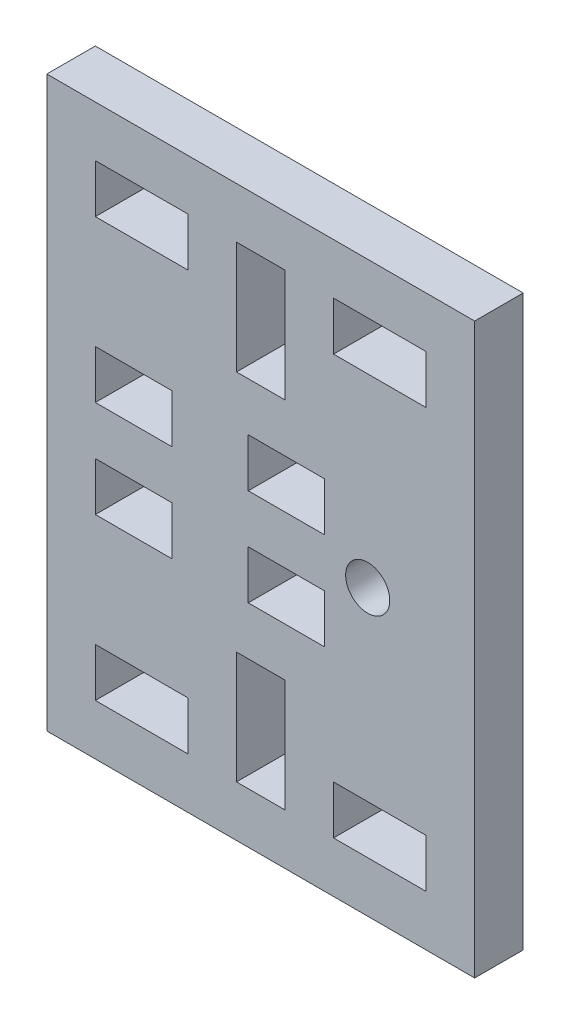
ISO-10303-21;
HEADER;
FILE_DESCRIPTION(('STEP AP214'),'2;1');
FILE_NAME('part.step','',(''),(''),'','','');
FILE_SCHEMA(('AUTOMOTIVE_DESIGN { 1 0 10303 214 1 1 1 1 }'));
ENDSEC;
DATA;
#1=APPLICATION_CONTEXT('core data for automotive mechanical design processes');
#2=APPLICATION_PROTOCOL_DEFINITION('international standard','automotive_design',2000,#1);
#3=PRODUCT_CONTEXT('',#1,'mechanical');
#4=PRODUCT('Part','Part','',(#3));
#5=PRODUCT_RELATED_PRODUCT_CATEGORY('part','',(#4));
#6=PRODUCT_DEFINITION_FORMATION('','',#4);
#7=PRODUCT_DEFINITION_CONTEXT('part definition',#1,'design');
#8=PRODUCT_DEFINITION('design','',#6,#7);
#9=PRODUCT_DEFINITION_SHAPE('','',#8);
#10=(LENGTH_UNIT() NAMED_UNIT(*) SI_UNIT(.MILLI.,.METRE.));
#11=(NAMED_UNIT(*) PLANE_ANGLE_UNIT() SI_UNIT($,.RADIAN.));
#12=(NAMED_UNIT(*) SI_UNIT($,.STERADIAN.) SOLID_ANGLE_UNIT());
#13=UNCERTAINTY_MEASURE_WITH_UNIT(LENGTH_MEASURE(1.E-05),#10,'distance_accuracy_value','');
#14=(GEOMETRIC_REPRESENTATION_CONTEXT(3) GLOBAL_UNCERTAINTY_ASSIGNED_CONTEXT((#13)) GLOBAL_UNIT_ASSIGNED_CONTEXT((#10,
#11,#12)) REPRESENTATION_CONTEXT('',''));
#15=CARTESIAN_POINT('',(0.,0.,0.));
#16=DIRECTION('',(0.,0.,1.));
#17=DIRECTION('',(1.,0.,0.));
#18=AXIS2_PLACEMENT_3D('',#15,#16,#17);
#19=CARTESIAN_POINT('',(0.,0.,5.5));
#20=DIRECTION('',(0.,0.,1.));
#21=DIRECTION('',(1.,0.,0.));
#22=AXIS2_PLACEMENT_3D('',#19,#20,#21);
#23=PLANE('',#22);
#24=DIRECTION('',(1.,0.,0.));
#25=VECTOR('',#24,1.);
#26=CARTESIAN_POINT('',(13.8203182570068,20.5986306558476,5.5));
#27=LINE('',#26,#25);
#28=CARTESIAN_POINT('',(3.32031825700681,20.5986306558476,5.5));
#29=VERTEX_POINT('',#28);
#30=CARTESIAN_POINT('',(13.8203182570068,20.5986306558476,5.5));
#31=VERTEX_POINT('',#30);
#32=EDGE_CURVE('E638',#29,#31,#27,.T.);
#33=ORIENTED_EDGE('',*,*,#32,.F.);
#34=DIRECTION('',(0.,-1.,0.));
#35=VECTOR('',#34,1.);
#36=CARTESIAN_POINT('',(3.32031825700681,20.5986306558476,5.5));
#37=LINE('',#36,#35);
#38=CARTESIAN_POINT('',(3.32031825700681,26.0986306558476,5.5));
#39=VERTEX_POINT('',#38);
#40=EDGE_CURVE('E635',#39,#29,#37,.T.);
#41=ORIENTED_EDGE('',*,*,#40,.F.);
#42=DIRECTION('',(-1.,0.,0.));
#43=VECTOR('',#42,1.);
#44=CARTESIAN_POINT('',(3.32031825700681,26.0986306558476,5.5));
#45=LINE('',#44,#43);
#46=CARTESIAN_POINT('',(13.8203182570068,26.0986306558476,5.5));
#47=VERTEX_POINT('',#46);
#48=EDGE_CURVE('E646',#47,#39,#45,.T.);
#49=ORIENTED_EDGE('',*,*,#48,.F.);
#50=DIRECTION('',(0.,1.,0.));
#51=VECTOR('',#50,1.);
#52=CARTESIAN_POINT('',(13.8203182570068,26.0986306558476,5.5));
#53=LINE('',#52,#51);
#54=EDGE_CURVE('E642',#31,#47,#53,.T.);
#55=ORIENTED_EDGE('',*,*,#54,.F.);
#56=EDGE_LOOP('',(#33,#41,#49,#55));
#57=FACE_BOUND('',#56,.T.);
#58=DIRECTION('',(1.,0.,0.));
#59=VECTOR('',#58,1.);
#60=CARTESIAN_POINT('',(13.8203182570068,-26.9013693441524,5.5));
#61=LINE('',#60,#59);
#62=CARTESIAN_POINT('',(3.32031825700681,-26.9013693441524,5.5));
#63=VERTEX_POINT('',#62);
#64=CARTESIAN_POINT('',(13.8203182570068,-26.9013693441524,5.5));
#65=VERTEX_POINT('',#64);
#66=EDGE_CURVE('E681',#63,#65,#61,.T.);
#67=ORIENTED_EDGE('',*,*,#66,.F.);
#68=DIRECTION('',(0.,-1.,0.));
#69=VECTOR('',#68,1.);
#70=CARTESIAN_POINT('',(3.32031825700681,-26.9013693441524,5.5));
#71=LINE('',#70,#69);
#72=CARTESIAN_POINT('',(3.32031825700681,-21.4013693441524,5.5));
#73=VERTEX_POINT('',#72);
#74=EDGE_CURVE('E678',#73,#63,#71,.T.);
#75=ORIENTED_EDGE('',*,*,#74,.F.);
#76=DIRECTION('',(-1.,0.,0.));
#77=VECTOR('',#76,1.);
#78=CARTESIAN_POINT('',(3.32031825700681,-21.4013693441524,5.5));
#79=LINE('',#78,#77);
#80=CARTESIAN_POINT('',(13.8203182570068,-21.4013693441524,5.5));
#81=VERTEX_POINT('',#80);
#82=EDGE_CURVE('E689',#81,#73,#79,.T.);
#83=ORIENTED_EDGE('',*,*,#82,.F.);
#84=DIRECTION('',(0.,1.,0.));
#85=VECTOR('',#84,1.);
#86=CARTESIAN_POINT('',(13.8203182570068,-21.4013693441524,5.5));
#87=LINE('',#86,#85);
#88=EDGE_CURVE('E685',#65,#81,#87,.T.);
#89=ORIENTED_EDGE('',*,*,#88,.F.);
#90=EDGE_LOOP('',(#67,#75,#83,#89));
#91=FACE_BOUND('',#90,.T.);
#92=DIRECTION('',(-1.,0.,0.));
#93=VECTOR('',#92,1.);
#94=CARTESIAN_POINT('',(30.3203182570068,-21.4013693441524,5.5));
#95=LINE('',#94,#93);
#96=CARTESIAN_POINT('',(40.8203182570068,-21.4013693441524,5.5));
#97=VERTEX_POINT('',#96);
#98=CARTESIAN_POINT('',(30.3203182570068,-21.4013693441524,5.5));
#99=VERTEX_POINT('',#98);
#100=EDGE_CURVE('E724',#97,#99,#95,.T.);
#101=ORIENTED_EDGE('',*,*,#100,.F.);
#102=DIRECTION('',(0.,1.,0.));
#103=VECTOR('',#102,1.);
#104=CARTESIAN_POINT('',(40.8203182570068,-21.4013693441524,5.5));
#105=LINE('',#104,#103);
#106=CARTESIAN_POINT('',(40.8203182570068,-26.9013693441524,5.5));
#107=VERTEX_POINT('',#106);
#108=EDGE_CURVE('E721',#107,#97,#105,.T.);
#109=ORIENTED_EDGE('',*,*,#108,.F.);
#110=DIRECTION('',(1.,0.,0.));
#111=VECTOR('',#110,1.);
#112=CARTESIAN_POINT('',(40.8203182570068,-26.9013693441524,5.5));
#113=LINE('',#112,#111);
#114=CARTESIAN_POINT('',(30.3203182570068,-26.9013693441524,5.5));
#115=VERTEX_POINT('',#114);
#116=EDGE_CURVE('E732',#115,#107,#113,.T.);
#117=ORIENTED_EDGE('',*,*,#116,.F.);
#118=DIRECTION('',(0.,-1.,0.));
#119=VECTOR('',#118,1.);
#120=CARTESIAN_POINT('',(30.3203182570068,-26.9013693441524,5.5));
#121=LINE('',#120,#119);
#122=EDGE_CURVE('E728',#99,#115,#121,.T.);
#123=ORIENTED_EDGE('',*,*,#122,.F.);
#124=EDGE_LOOP('',(#101,#109,#117,#123));
#125=FACE_BOUND('',#124,.T.);
#126=DIRECTION('',(1.,0.,0.));
#127=VECTOR('',#126,1.);
#128=CARTESIAN_POINT('',(46.3203182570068,-32.6513693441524,5.5));
#129=LINE('',#128,#127);
#130=CARTESIAN_POINT('',(-2.17968175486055,-32.6513693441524,5.5));
#131=VERTEX_POINT('',#130);
#132=CARTESIAN_POINT('',(46.3203182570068,-32.6513693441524,5.5));
#133=VERTEX_POINT('',#132);
#134=EDGE_CURVE('E764',#131,#133,#129,.T.);
#135=ORIENTED_EDGE('',*,*,#134,.T.);
#136=DIRECTION('',(0.,1.,0.));
#137=VECTOR('',#136,1.);
#138=CARTESIAN_POINT('',(46.3203182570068,31.8486306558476,5.5));
#139=LINE('',#138,#137);
#140=CARTESIAN_POINT('',(46.3203182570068,31.8486306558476,5.5));
#141=VERTEX_POINT('',#140);
#142=EDGE_CURVE('E768',#133,#141,#139,.T.);
#143=ORIENTED_EDGE('',*,*,#142,.T.);
#144=DIRECTION('',(-1.,0.,0.));
#145=VECTOR('',#144,1.);
#146=CARTESIAN_POINT('',(-2.17968175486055,31.8486306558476,5.5));
#147=LINE('',#146,#145);
#148=CARTESIAN_POINT('',(-2.17968175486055,31.8486306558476,5.5));
#149=VERTEX_POINT('',#148);
#150=EDGE_CURVE('E772',#141,#149,#147,.T.);
#151=ORIENTED_EDGE('',*,*,#150,.T.);
#152=DIRECTION('',(0.,-1.,0.));
#153=VECTOR('',#152,1.);
#154=CARTESIAN_POINT('',(-2.17968175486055,31.8486306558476,5.5));
#155=LINE('',#154,#153);
#156=EDGE_CURVE('E775',#149,#131,#155,.T.);
#157=ORIENTED_EDGE('',*,*,#156,.T.);
#158=EDGE_LOOP('',(#135,#143,#151,#157));
#159=FACE_BOUND('',#158,.T.);
#160=CARTESIAN_POINT('',(34.19531825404,-0.40136934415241,5.5));
#161=DIRECTION('',(0.,0.,1.));
#162=DIRECTION('',(1.,0.,0.));
#163=AXIS2_PLACEMENT_3D('',#160,#161,#162);
#164=CIRCLE('',#163,2.5);
#165=CARTESIAN_POINT('',(36.69531825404,-0.40136934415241,5.5));
#166=VERTEX_POINT('',#165);
#167=EDGE_CURVE('E627',#166,#166,#164,.T.);
#168=ORIENTED_EDGE('',*,*,#167,.F.);
#169=EDGE_LOOP('',(#168));
#170=FACE_BOUND('',#169,.T.);
#171=DIRECTION('',(-1.,0.,0.));
#172=VECTOR('',#171,1.);
#173=CARTESIAN_POINT('',(30.3203182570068,26.0986306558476,5.5));
#174=LINE('',#173,#172);
#175=CARTESIAN_POINT('',(40.8203182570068,26.0986306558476,5.5));
#176=VERTEX_POINT('',#175);
#177=CARTESIAN_POINT('',(30.3203182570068,26.0986306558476,5.5));
#178=VERTEX_POINT('',#177);
#179=EDGE_CURVE('E587',#176,#178,#174,.T.);
#180=ORIENTED_EDGE('',*,*,#179,.F.);
#181=DIRECTION('',(0.,1.,0.));
#182=VECTOR('',#181,1.);
#183=CARTESIAN_POINT('',(40.8203182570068,26.0986306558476,5.5));
#184=LINE('',#183,#182);
#185=CARTESIAN_POINT('',(40.8203182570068,20.5986306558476,5.5));
#186=VERTEX_POINT('',#185);
#187=EDGE_CURVE('E584',#186,#176,#184,.T.);
#188=ORIENTED_EDGE('',*,*,#187,.F.);
#189=DIRECTION('',(1.,0.,0.));
#190=VECTOR('',#189,1.);
#191=CARTESIAN_POINT('',(40.8203182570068,20.5986306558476,5.5));
#192=LINE('',#191,#190);
#193=CARTESIAN_POINT('',(30.3203182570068,20.5986306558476,5.5));
#194=VERTEX_POINT('',#193);
#195=EDGE_CURVE('E595',#194,#186,#192,.T.);
#196=ORIENTED_EDGE('',*,*,#195,.F.);
#197=DIRECTION('',(0.,-1.,0.));
#198=VECTOR('',#197,1.);
#199=CARTESIAN_POINT('',(30.3203182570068,20.5986306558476,5.5));
#200=LINE('',#199,#198);
#201=EDGE_CURVE('E591',#178,#194,#200,.T.);
#202=ORIENTED_EDGE('',*,*,#201,.F.);
#203=EDGE_LOOP('',(#180,#188,#196,#202));
#204=FACE_BOUND('',#203,.T.);
#205=DIRECTION('',(0.,-1.,0.));
#206=VECTOR('',#205,1.);
#207=CARTESIAN_POINT('',(19.3203182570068,26.0986306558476,5.5));
#208=LINE('',#207,#206);
#209=CARTESIAN_POINT('',(19.3203182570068,26.0986306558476,5.5));
#210=VERTEX_POINT('',#209);
#211=CARTESIAN_POINT('',(19.3203182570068,13.3486306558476,5.5));
#212=VERTEX_POINT('',#211);
#213=EDGE_CURVE('E544',#210,#212,#208,.T.);
#214=ORIENTED_EDGE('',*,*,#213,.F.);
#215=DIRECTION('',(-1.,0.,0.));
#216=VECTOR('',#215,1.);
#217=CARTESIAN_POINT('',(24.8203182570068,26.0986306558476,5.5));
#218=LINE('',#217,#216);
#219=CARTESIAN_POINT('',(24.8203182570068,26.0986306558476,5.5));
#220=VERTEX_POINT('',#219);
#221=EDGE_CURVE('E541',#220,#210,#218,.T.);
#222=ORIENTED_EDGE('',*,*,#221,.F.);
#223=DIRECTION('',(0.,1.,0.));
#224=VECTOR('',#223,1.);
#225=CARTESIAN_POINT('',(24.8203182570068,13.3486306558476,5.5));
#226=LINE('',#225,#224);
#227=CARTESIAN_POINT('',(24.8203182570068,13.3486306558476,5.5));
#228=VERTEX_POINT('',#227);
#229=EDGE_CURVE('E552',#228,#220,#226,.T.);
#230=ORIENTED_EDGE('',*,*,#229,.F.);
#231=DIRECTION('',(1.,0.,0.));
#232=VECTOR('',#231,1.);
#233=CARTESIAN_POINT('',(19.3203182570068,13.3486306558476,5.5));
#234=LINE('',#233,#232);
#235=EDGE_CURVE('E548',#212,#228,#234,.T.);
#236=ORIENTED_EDGE('',*,*,#235,.F.);
#237=EDGE_LOOP('',(#214,#222,#230,#236));
#238=FACE_BOUND('',#237,.T.);
#239=DIRECTION('',(0.,1.,0.));
#240=VECTOR('',#239,1.);
#241=CARTESIAN_POINT('',(24.8203182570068,-14.1513693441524,5.5));
#242=LINE('',#241,#240);
#243=CARTESIAN_POINT('',(24.8203182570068,-26.9013693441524,5.5));
#244=VERTEX_POINT('',#243);
#245=CARTESIAN_POINT('',(24.8203182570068,-14.1513693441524,5.5));
#246=VERTEX_POINT('',#245);
#247=EDGE_CURVE('E501',#244,#246,#242,.T.);
#248=ORIENTED_EDGE('',*,*,#247,.F.);
#249=DIRECTION('',(1.,0.,0.));
#250=VECTOR('',#249,1.);
#251=CARTESIAN_POINT('',(24.8203182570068,-26.9013693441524,5.5));
#252=LINE('',#251,#250);
#253=CARTESIAN_POINT('',(19.3203182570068,-26.9013693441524,5.5));
#254=VERTEX_POINT('',#253);
#255=EDGE_CURVE('E498',#254,#244,#252,.T.);
#256=ORIENTED_EDGE('',*,*,#255,.F.);
#257=DIRECTION('',(0.,-1.,0.));
#258=VECTOR('',#257,1.);
#259=CARTESIAN_POINT('',(19.3203182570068,-26.9013693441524,5.5));
#260=LINE('',#259,#258);
#261=CARTESIAN_POINT('',(19.3203182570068,-14.1513693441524,5.5));
#262=VERTEX_POINT('',#261);
#263=EDGE_CURVE('E509',#262,#254,#260,.T.);
#264=ORIENTED_EDGE('',*,*,#263,.F.);
#265=DIRECTION('',(-1.,0.,0.));
#266=VECTOR('',#265,1.);
#267=CARTESIAN_POINT('',(19.3203182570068,-14.1513693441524,5.5));
#268=LINE('',#267,#266);
#269=EDGE_CURVE('E505',#246,#262,#268,.T.);
#270=ORIENTED_EDGE('',*,*,#269,.F.);
#271=EDGE_LOOP('',(#248,#256,#264,#270));
#272=FACE_BOUND('',#271,.T.);
#273=DIRECTION('',(0.,1.,0.));
#274=VECTOR('',#273,1.);
#275=CARTESIAN_POINT('',(29.3203182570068,-3.15136934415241,5.5));
#276=LINE('',#275,#274);
#277=CARTESIAN_POINT('',(29.3203182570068,-8.65136934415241,5.5));
#278=VERTEX_POINT('',#277);
#279=CARTESIAN_POINT('',(29.3203182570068,-3.15136934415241,5.5));
#280=VERTEX_POINT('',#279);
#281=EDGE_CURVE('E458',#278,#280,#276,.T.);
#282=ORIENTED_EDGE('',*,*,#281,.F.);
#283=DIRECTION('',(1.,0.,0.));
#284=VECTOR('',#283,1.);
#285=CARTESIAN_POINT('',(29.3203182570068,-8.65136934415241,5.5));
#286=LINE('',#285,#284);
#287=CARTESIAN_POINT('',(20.6536515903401,-8.65136934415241,5.5));
#288=VERTEX_POINT('',#287);
#289=EDGE_CURVE('E455',#288,#278,#286,.T.);
#290=ORIENTED_EDGE('',*,*,#289,.F.);
#291=DIRECTION('',(0.,-1.,0.));
#292=VECTOR('',#291,1.);
#293=CARTESIAN_POINT('',(20.6536515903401,-8.65136934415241,5.5));
#294=LINE('',#293,#292);
#295=CARTESIAN_POINT('',(20.6536515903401,-3.15136934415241,5.5));
#296=VERTEX_POINT('',#295);
#297=EDGE_CURVE('E466',#296,#288,#294,.T.);
#298=ORIENTED_EDGE('',*,*,#297,.F.);
#299=DIRECTION('',(-1.,0.,0.));
#300=VECTOR('',#299,1.);
#301=CARTESIAN_POINT('',(20.6536515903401,-3.15136934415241,5.5));
#302=LINE('',#301,#300);
#303=EDGE_CURVE('E462',#280,#296,#302,.T.);
#304=ORIENTED_EDGE('',*,*,#303,.F.);
#305=EDGE_LOOP('',(#282,#290,#298,#304));
#306=FACE_BOUND('',#305,.T.);
#307=DIRECTION('',(1.,0.,0.));
#308=VECTOR('',#307,1.);
#309=CARTESIAN_POINT('',(11.9869849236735,-8.65136934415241,5.5));
#310=LINE('',#309,#308);
#311=CARTESIAN_POINT('',(3.32031825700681,-8.65136934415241,5.5));
#312=VERTEX_POINT('',#311);
#313=CARTESIAN_POINT('',(11.9869849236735,-8.65136934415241,5.5));
#314=VERTEX_POINT('',#313);
#315=EDGE_CURVE('E415',#312,#314,#310,.T.);
#316=ORIENTED_EDGE('',*,*,#315,.F.);
#317=DIRECTION('',(0.,-1.,0.));
#318=VECTOR('',#317,1.);
#319=CARTESIAN_POINT('',(3.32031825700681,-8.65136934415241,5.5));
#320=LINE('',#319,#318);
#321=CARTESIAN_POINT('',(3.32031825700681,-3.15136934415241,5.5));
#322=VERTEX_POINT('',#321);
#323=EDGE_CURVE('E412',#322,#312,#320,.T.);
#324=ORIENTED_EDGE('',*,*,#323,.F.);
#325=DIRECTION('',(-1.,0.,0.));
#326=VECTOR('',#325,1.);
#327=CARTESIAN_POINT('',(3.32031825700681,-3.15136934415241,5.5));
#328=LINE('',#327,#326);
#329=CARTESIAN_POINT('',(11.9869849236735,-3.15136934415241,5.5));
#330=VERTEX_POINT('',#329);
#331=EDGE_CURVE('E423',#330,#322,#328,.T.);
#332=ORIENTED_EDGE('',*,*,#331,.F.);
#333=DIRECTION('',(0.,1.,0.));
#334=VECTOR('',#333,1.);
#335=CARTESIAN_POINT('',(11.9869849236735,-3.15136934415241,5.5));
#336=LINE('',#335,#334);
#337=EDGE_CURVE('E419',#314,#330,#336,.T.);
#338=ORIENTED_EDGE('',*,*,#337,.F.);
#339=EDGE_LOOP('',(#316,#324,#332,#338));
#340=FACE_BOUND('',#339,.T.);
#341=DIRECTION('',(-1.,0.,0.));
#342=VECTOR('',#341,1.);
#343=CARTESIAN_POINT('',(20.6536515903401,7.84863065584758,5.5));
#344=LINE('',#343,#342);
#345=CARTESIAN_POINT('',(29.3203182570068,7.84863065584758,5.5));
#346=VERTEX_POINT('',#345);
#347=CARTESIAN_POINT('',(20.6536515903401,7.84863065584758,5.5));
#348=VERTEX_POINT('',#347);
#349=EDGE_CURVE('E372',#346,#348,#344,.T.);
#350=ORIENTED_EDGE('',*,*,#349,.F.);
#351=DIRECTION('',(0.,1.,0.));
#352=VECTOR('',#351,1.);
#353=CARTESIAN_POINT('',(29.3203182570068,7.84863065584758,5.5));
#354=LINE('',#353,#352);
#355=CARTESIAN_POINT('',(29.3203182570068,2.34863065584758,5.5));
#356=VERTEX_POINT('',#355);
#357=EDGE_CURVE('E369',#356,#346,#354,.T.);
#358=ORIENTED_EDGE('',*,*,#357,.F.);
#359=DIRECTION('',(1.,0.,0.));
#360=VECTOR('',#359,1.);
#361=CARTESIAN_POINT('',(29.3203182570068,2.34863065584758,5.5));
#362=LINE('',#361,#360);
#363=CARTESIAN_POINT('',(20.6536515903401,2.34863065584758,5.5));
#364=VERTEX_POINT('',#363);
#365=EDGE_CURVE('E380',#364,#356,#362,.T.);
#366=ORIENTED_EDGE('',*,*,#365,.F.);
#367=DIRECTION('',(0.,-1.,0.));
#368=VECTOR('',#367,1.);
#369=CARTESIAN_POINT('',(20.6536515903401,2.34863065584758,5.5));
#370=LINE('',#369,#368);
#371=EDGE_CURVE('E376',#348,#364,#370,.T.);
#372=ORIENTED_EDGE('',*,*,#371,.F.);
#373=EDGE_LOOP('',(#350,#358,#366,#372));
#374=FACE_BOUND('',#373,.T.);
#375=DIRECTION('',(1.,0.,0.));
#376=VECTOR('',#375,1.);
#377=CARTESIAN_POINT('',(11.9869849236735,2.34863065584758,5.5));
#378=LINE('',#377,#376);
#379=CARTESIAN_POINT('',(3.32031825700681,2.34863065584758,5.5));
#380=VERTEX_POINT('',#379);
#381=CARTESIAN_POINT('',(11.9869849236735,2.34863065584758,5.5));
#382=VERTEX_POINT('',#381);
#383=EDGE_CURVE('E330',#380,#382,#378,.T.);
#384=ORIENTED_EDGE('',*,*,#383,.F.);
#385=DIRECTION('',(0.,-1.,0.));
#386=VECTOR('',#385,1.);
#387=CARTESIAN_POINT('',(3.32031825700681,2.34863065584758,5.5));
#388=LINE('',#387,#386);
#389=CARTESIAN_POINT('',(3.32031825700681,7.84863065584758,5.5));
#390=VERTEX_POINT('',#389);
#391=EDGE_CURVE('E321',#390,#380,#388,.T.);
#392=ORIENTED_EDGE('',*,*,#391,.F.);
#393=DIRECTION('',(-1.,0.,0.));
#394=VECTOR('',#393,1.);
#395=CARTESIAN_POINT('',(3.32031825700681,7.84863065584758,5.5));
#396=LINE('',#395,#394);
#397=CARTESIAN_POINT('',(11.9869849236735,7.84863065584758,5.5));
#398=VERTEX_POINT('',#397);
#399=EDGE_CURVE('E347',#398,#390,#396,.T.);
#400=ORIENTED_EDGE('',*,*,#399,.F.);
#401=DIRECTION('',(0.,1.,0.));
#402=VECTOR('',#401,1.);
#403=CARTESIAN_POINT('',(11.9869849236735,7.84863065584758,5.5));
#404=LINE('',#403,#402);
#405=EDGE_CURVE('E343',#382,#398,#404,.T.);
#406=ORIENTED_EDGE('',*,*,#405,.F.);
#407=EDGE_LOOP('',(#384,#392,#400,#406));
#408=FACE_BOUND('',#407,.T.);
#409=ADVANCED_FACE('F39',(#57,#91,#125,#159,#170,#204,#238,#272,#306,#340,#374,#408),#23,.T.);
#410=CARTESIAN_POINT('',(0.,0.,0.));
#411=DIRECTION('',(0.,0.,1.));
#412=DIRECTION('',(1.,0.,0.));
#413=AXIS2_PLACEMENT_3D('',#410,#411,#412);
#414=PLANE('',#413);
#415=DIRECTION('',(0.,1.,0.));
#416=VECTOR('',#415,1.);
#417=CARTESIAN_POINT('',(29.3203182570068,7.84863065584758,0.));
#418=LINE('',#417,#416);
#419=CARTESIAN_POINT('',(29.3203182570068,2.34863065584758,0.));
#420=VERTEX_POINT('',#419);
#421=CARTESIAN_POINT('',(29.3203182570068,7.84863065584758,0.));
#422=VERTEX_POINT('',#421);
#423=EDGE_CURVE('E339',#420,#422,#418,.T.);
#424=ORIENTED_EDGE('',*,*,#423,.T.);
#425=DIRECTION('',(-1.,0.,0.));
#426=VECTOR('',#425,1.);
#427=CARTESIAN_POINT('',(20.6536515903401,7.84863065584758,0.));
#428=LINE('',#427,#426);
#429=CARTESIAN_POINT('',(20.6536515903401,7.84863065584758,0.));
#430=VERTEX_POINT('',#429);
#431=EDGE_CURVE('E387',#422,#430,#428,.T.);
#432=ORIENTED_EDGE('',*,*,#431,.T.);
#433=DIRECTION('',(0.,-1.,0.));
#434=VECTOR('',#433,1.);
#435=CARTESIAN_POINT('',(20.6536515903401,2.34863065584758,0.));
#436=LINE('',#435,#434);
#437=CARTESIAN_POINT('',(20.6536515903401,2.34863065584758,0.));
#438=VERTEX_POINT('',#437);
#439=EDGE_CURVE('E391',#430,#438,#436,.T.);
#440=ORIENTED_EDGE('',*,*,#439,.T.);
#441=DIRECTION('',(1.,0.,0.));
#442=VECTOR('',#441,1.);
#443=CARTESIAN_POINT('',(29.3203182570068,2.34863065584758,0.));
#444=LINE('',#443,#442);
#445=EDGE_CURVE('E373',#438,#420,#444,.T.);
#446=ORIENTED_EDGE('',*,*,#445,.T.);
#447=EDGE_LOOP('',(#424,#432,#440,#446));
#448=FACE_BOUND('',#447,.T.);
#449=DIRECTION('',(1.,0.,0.));
#450=VECTOR('',#449,1.);
#451=CARTESIAN_POINT('',(29.3203182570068,-8.65136934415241,0.));
#452=LINE('',#451,#450);
#453=CARTESIAN_POINT('',(20.6536515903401,-8.65136934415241,0.));
#454=VERTEX_POINT('',#453);
#455=CARTESIAN_POINT('',(29.3203182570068,-8.65136934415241,0.));
#456=VERTEX_POINT('',#455);
#457=EDGE_CURVE('E454',#454,#456,#452,.T.);
#458=ORIENTED_EDGE('',*,*,#457,.T.);
#459=DIRECTION('',(0.,1.,0.));
#460=VECTOR('',#459,1.);
#461=CARTESIAN_POINT('',(29.3203182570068,-3.15136934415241,0.));
#462=LINE('',#461,#460);
#463=CARTESIAN_POINT('',(29.3203182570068,-3.15136934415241,0.));
#464=VERTEX_POINT('',#463);
#465=EDGE_CURVE('E473',#456,#464,#462,.T.);
#466=ORIENTED_EDGE('',*,*,#465,.T.);
#467=DIRECTION('',(-1.,0.,0.));
#468=VECTOR('',#467,1.);
#469=CARTESIAN_POINT('',(20.6536515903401,-3.15136934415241,0.));
#470=LINE('',#469,#468);
#471=CARTESIAN_POINT('',(20.6536515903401,-3.15136934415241,0.));
#472=VERTEX_POINT('',#471);
#473=EDGE_CURVE('E477',#464,#472,#470,.T.);
#474=ORIENTED_EDGE('',*,*,#473,.T.);
#475=DIRECTION('',(0.,-1.,0.));
#476=VECTOR('',#475,1.);
#477=CARTESIAN_POINT('',(20.6536515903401,-8.65136934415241,0.));
#478=LINE('',#477,#476);
#479=EDGE_CURVE('E459',#472,#454,#478,.T.);
#480=ORIENTED_EDGE('',*,*,#479,.T.);
#481=EDGE_LOOP('',(#458,#466,#474,#480));
#482=FACE_BOUND('',#481,.T.);
#483=DIRECTION('',(-1.,0.,0.));
#484=VECTOR('',#483,1.);
#485=CARTESIAN_POINT('',(24.8203182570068,26.0986306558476,0.));
#486=LINE('',#485,#484);
#487=CARTESIAN_POINT('',(24.8203182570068,26.0986306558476,0.));
#488=VERTEX_POINT('',#487);
#489=CARTESIAN_POINT('',(19.3203182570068,26.0986306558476,0.));
#490=VERTEX_POINT('',#489);
#491=EDGE_CURVE('E540',#488,#490,#486,.T.);
#492=ORIENTED_EDGE('',*,*,#491,.T.);
#493=DIRECTION('',(0.,-1.,0.));
#494=VECTOR('',#493,1.);
#495=CARTESIAN_POINT('',(19.3203182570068,26.0986306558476,0.));
#496=LINE('',#495,#494);
#497=CARTESIAN_POINT('',(19.3203182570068,13.3486306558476,0.));
#498=VERTEX_POINT('',#497);
#499=EDGE_CURVE('E559',#490,#498,#496,.T.);
#500=ORIENTED_EDGE('',*,*,#499,.T.);
#501=DIRECTION('',(1.,0.,0.));
#502=VECTOR('',#501,1.);
#503=CARTESIAN_POINT('',(19.3203182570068,13.3486306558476,0.));
#504=LINE('',#503,#502);
#505=CARTESIAN_POINT('',(24.8203182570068,13.3486306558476,0.));
#506=VERTEX_POINT('',#505);
#507=EDGE_CURVE('E563',#498,#506,#504,.T.);
#508=ORIENTED_EDGE('',*,*,#507,.T.);
#509=DIRECTION('',(0.,1.,0.));
#510=VECTOR('',#509,1.);
#511=CARTESIAN_POINT('',(24.8203182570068,13.3486306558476,0.));
#512=LINE('',#511,#510);
#513=EDGE_CURVE('E545',#506,#488,#512,.T.);
#514=ORIENTED_EDGE('',*,*,#513,.T.);
#515=EDGE_LOOP('',(#492,#500,#508,#514));
#516=FACE_BOUND('',#515,.T.);
#517=CARTESIAN_POINT('',(34.19531825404,-0.40136934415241,0.));
#518=DIRECTION('',(0.,0.,1.));
#519=DIRECTION('',(1.,0.,0.));
#520=AXIS2_PLACEMENT_3D('',#517,#518,#519);
#521=CIRCLE('',#520,2.5);
#522=CARTESIAN_POINT('',(36.69531825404,-0.40136934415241,0.));
#523=VERTEX_POINT('',#522);
#524=EDGE_CURVE('E626',#523,#523,#521,.T.);
#525=ORIENTED_EDGE('',*,*,#524,.T.);
#526=EDGE_LOOP('',(#525));
#527=FACE_BOUND('',#526,.T.);
#528=DIRECTION('',(0.,-1.,0.));
#529=VECTOR('',#528,1.);
#530=CARTESIAN_POINT('',(3.32031825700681,20.5986306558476,0.));
#531=LINE('',#530,#529);
#532=CARTESIAN_POINT('',(3.32031825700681,26.0986306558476,0.));
#533=VERTEX_POINT('',#532);
#534=CARTESIAN_POINT('',(3.32031825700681,20.5986306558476,0.));
#535=VERTEX_POINT('',#534);
#536=EDGE_CURVE('E631',#533,#535,#531,.T.);
#537=ORIENTED_EDGE('',*,*,#536,.T.);
#538=DIRECTION('',(1.,0.,0.));
#539=VECTOR('',#538,1.);
#540=CARTESIAN_POINT('',(13.8203182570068,20.5986306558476,0.));
#541=LINE('',#540,#539);
#542=CARTESIAN_POINT('',(13.8203182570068,20.5986306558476,0.));
#543=VERTEX_POINT('',#542);
#544=EDGE_CURVE('E653',#535,#543,#541,.T.);
#545=ORIENTED_EDGE('',*,*,#544,.T.);
#546=DIRECTION('',(0.,1.,0.));
#547=VECTOR('',#546,1.);
#548=CARTESIAN_POINT('',(13.8203182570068,26.0986306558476,0.));
#549=LINE('',#548,#547);
#550=CARTESIAN_POINT('',(13.8203182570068,26.0986306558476,0.));
#551=VERTEX_POINT('',#550);
#552=EDGE_CURVE('E657',#543,#551,#549,.T.);
#553=ORIENTED_EDGE('',*,*,#552,.T.);
#554=DIRECTION('',(-1.,0.,0.));
#555=VECTOR('',#554,1.);
#556=CARTESIAN_POINT('',(3.32031825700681,26.0986306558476,0.));
#557=LINE('',#556,#555);
#558=EDGE_CURVE('E639',#551,#533,#557,.T.);
#559=ORIENTED_EDGE('',*,*,#558,.T.);
#560=EDGE_LOOP('',(#537,#545,#553,#559));
#561=FACE_BOUND('',#560,.T.);
#562=DIRECTION('',(0.,1.,0.));
#563=VECTOR('',#562,1.);
#564=CARTESIAN_POINT('',(40.8203182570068,-21.4013693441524,0.));
#565=LINE('',#564,#563);
#566=CARTESIAN_POINT('',(40.8203182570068,-26.9013693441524,0.));
#567=VERTEX_POINT('',#566);
#568=CARTESIAN_POINT('',(40.8203182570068,-21.4013693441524,0.));
#569=VERTEX_POINT('',#568);
#570=EDGE_CURVE('E720',#567,#569,#565,.T.);
#571=ORIENTED_EDGE('',*,*,#570,.T.);
#572=DIRECTION('',(-1.,0.,0.));
#573=VECTOR('',#572,1.);
#574=CARTESIAN_POINT('',(30.3203182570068,-21.4013693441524,0.));
#575=LINE('',#574,#573);
#576=CARTESIAN_POINT('',(30.3203182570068,-21.4013693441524,0.));
#577=VERTEX_POINT('',#576);
#578=EDGE_CURVE('E739',#569,#577,#575,.T.);
#579=ORIENTED_EDGE('',*,*,#578,.T.);
#580=DIRECTION('',(0.,-1.,0.));
#581=VECTOR('',#580,1.);
#582=CARTESIAN_POINT('',(30.3203182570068,-26.9013693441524,0.));
#583=LINE('',#582,#581);
#584=CARTESIAN_POINT('',(30.3203182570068,-26.9013693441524,0.));
#585=VERTEX_POINT('',#584);
#586=EDGE_CURVE('E743',#577,#585,#583,.T.);
#587=ORIENTED_EDGE('',*,*,#586,.T.);
#588=DIRECTION('',(1.,0.,0.));
#589=VECTOR('',#588,1.);
#590=CARTESIAN_POINT('',(40.8203182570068,-26.9013693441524,0.));
#591=LINE('',#590,#589);
#592=EDGE_CURVE('E725',#585,#567,#591,.T.);
#593=ORIENTED_EDGE('',*,*,#592,.T.);
#594=EDGE_LOOP('',(#571,#579,#587,#593));
#595=FACE_BOUND('',#594,.T.);
#596=DIRECTION('',(1.,0.,0.));
#597=VECTOR('',#596,1.);
#598=CARTESIAN_POINT('',(46.3203182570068,-32.6513693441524,0.));
#599=LINE('',#598,#597);
#600=CARTESIAN_POINT('',(-2.17968175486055,-32.6513693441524,0.));
#601=VERTEX_POINT('',#600);
#602=CARTESIAN_POINT('',(46.3203182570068,-32.6513693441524,0.));
#603=VERTEX_POINT('',#602);
#604=EDGE_CURVE('E763',#601,#603,#599,.T.);
#605=ORIENTED_EDGE('',*,*,#604,.F.);
#606=DIRECTION('',(0.,-1.,0.));
#607=VECTOR('',#606,1.);
#608=CARTESIAN_POINT('',(-2.17968175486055,-21.4013693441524,0.));
#609=LINE('',#608,#607);
#610=CARTESIAN_POINT('',(-2.17968175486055,31.8486306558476,0.));
#611=VERTEX_POINT('',#610);
#612=EDGE_CURVE('E769',#611,#601,#609,.T.);
#613=ORIENTED_EDGE('',*,*,#612,.F.);
#614=DIRECTION('',(-1.,0.,0.));
#615=VECTOR('',#614,1.);
#616=CARTESIAN_POINT('',(-2.17968175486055,31.8486306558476,0.));
#617=LINE('',#616,#615);
#618=CARTESIAN_POINT('',(46.3203182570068,31.8486306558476,0.));
#619=VERTEX_POINT('',#618);
#620=EDGE_CURVE('E785',#619,#611,#617,.T.);
#621=ORIENTED_EDGE('',*,*,#620,.F.);
#622=DIRECTION('',(0.,1.,0.));
#623=VECTOR('',#622,1.);
#624=CARTESIAN_POINT('',(46.3203182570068,31.8486306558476,0.));
#625=LINE('',#624,#623);
#626=EDGE_CURVE('E782',#603,#619,#625,.T.);
#627=ORIENTED_EDGE('',*,*,#626,.F.);
#628=EDGE_LOOP('',(#605,#613,#621,#627));
#629=FACE_BOUND('',#628,.T.);
#630=DIRECTION('',(0.,-1.,0.));
#631=VECTOR('',#630,1.);
#632=CARTESIAN_POINT('',(3.32031825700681,-26.9013693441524,0.));
#633=LINE('',#632,#631);
#634=CARTESIAN_POINT('',(3.32031825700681,-21.4013693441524,0.));
#635=VERTEX_POINT('',#634);
#636=CARTESIAN_POINT('',(3.32031825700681,-26.9013693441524,0.));
#637=VERTEX_POINT('',#636);
#638=EDGE_CURVE('E677',#635,#637,#633,.T.);
#639=ORIENTED_EDGE('',*,*,#638,.T.);
#640=DIRECTION('',(1.,0.,0.));
#641=VECTOR('',#640,1.);
#642=CARTESIAN_POINT('',(13.8203182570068,-26.9013693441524,0.));
#643=LINE('',#642,#641);
#644=CARTESIAN_POINT('',(13.8203182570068,-26.9013693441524,0.));
#645=VERTEX_POINT('',#644);
#646=EDGE_CURVE('E696',#637,#645,#643,.T.);
#647=ORIENTED_EDGE('',*,*,#646,.T.);
#648=DIRECTION('',(0.,1.,0.));
#649=VECTOR('',#648,1.);
#650=CARTESIAN_POINT('',(13.8203182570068,-21.4013693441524,0.));
#651=LINE('',#650,#649);
#652=CARTESIAN_POINT('',(13.8203182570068,-21.4013693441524,0.));
#653=VERTEX_POINT('',#652);
#654=EDGE_CURVE('E700',#645,#653,#651,.T.);
#655=ORIENTED_EDGE('',*,*,#654,.T.);
#656=DIRECTION('',(-1.,0.,0.));
#657=VECTOR('',#656,1.);
#658=CARTESIAN_POINT('',(3.32031825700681,-21.4013693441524,0.));
#659=LINE('',#658,#657);
#660=EDGE_CURVE('E682',#653,#635,#659,.T.);
#661=ORIENTED_EDGE('',*,*,#660,.T.);
#662=EDGE_LOOP('',(#639,#647,#655,#661));
#663=FACE_BOUND('',#662,.T.);
#664=DIRECTION('',(0.,1.,0.));
#665=VECTOR('',#664,1.);
#666=CARTESIAN_POINT('',(40.8203182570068,26.0986306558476,0.));
#667=LINE('',#666,#665);
#668=CARTESIAN_POINT('',(40.8203182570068,20.5986306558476,0.));
#669=VERTEX_POINT('',#668);
#670=CARTESIAN_POINT('',(40.8203182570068,26.0986306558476,0.));
#671=VERTEX_POINT('',#670);
#672=EDGE_CURVE('E583',#669,#671,#667,.T.);
#673=ORIENTED_EDGE('',*,*,#672,.T.);
#674=DIRECTION('',(-1.,0.,0.));
#675=VECTOR('',#674,1.);
#676=CARTESIAN_POINT('',(30.3203182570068,26.0986306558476,0.));
#677=LINE('',#676,#675);
#678=CARTESIAN_POINT('',(30.3203182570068,26.0986306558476,0.));
#679=VERTEX_POINT('',#678);
#680=EDGE_CURVE('E602',#671,#679,#677,.T.);
#681=ORIENTED_EDGE('',*,*,#680,.T.);
#682=DIRECTION('',(0.,-1.,0.));
#683=VECTOR('',#682,1.);
#684=CARTESIAN_POINT('',(30.3203182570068,20.5986306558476,0.));
#685=LINE('',#684,#683);
#686=CARTESIAN_POINT('',(30.3203182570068,20.5986306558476,0.));
#687=VERTEX_POINT('',#686);
#688=EDGE_CURVE('E606',#679,#687,#685,.T.);
#689=ORIENTED_EDGE('',*,*,#688,.T.);
#690=DIRECTION('',(1.,0.,0.));
#691=VECTOR('',#690,1.);
#692=CARTESIAN_POINT('',(40.8203182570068,20.5986306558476,0.));
#693=LINE('',#692,#691);
#694=EDGE_CURVE('E588',#687,#669,#693,.T.);
#695=ORIENTED_EDGE('',*,*,#694,.T.);
#696=EDGE_LOOP('',(#673,#681,#689,#695));
#697=FACE_BOUND('',#696,.T.);
#698=DIRECTION('',(1.,0.,0.));
#699=VECTOR('',#698,1.);
#700=CARTESIAN_POINT('',(24.8203182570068,-26.9013693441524,0.));
#701=LINE('',#700,#699);
#702=CARTESIAN_POINT('',(19.3203182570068,-26.9013693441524,0.));
#703=VERTEX_POINT('',#702);
#704=CARTESIAN_POINT('',(24.8203182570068,-26.9013693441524,0.));
#705=VERTEX_POINT('',#704);
#706=EDGE_CURVE('E497',#703,#705,#701,.T.);
#707=ORIENTED_EDGE('',*,*,#706,.T.);
#708=DIRECTION('',(0.,1.,0.));
#709=VECTOR('',#708,1.);
#710=CARTESIAN_POINT('',(24.8203182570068,-14.1513693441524,0.));
#711=LINE('',#710,#709);
#712=CARTESIAN_POINT('',(24.8203182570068,-14.1513693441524,0.));
#713=VERTEX_POINT('',#712);
#714=EDGE_CURVE('E516',#705,#713,#711,.T.);
#715=ORIENTED_EDGE('',*,*,#714,.T.);
#716=DIRECTION('',(-1.,0.,0.));
#717=VECTOR('',#716,1.);
#718=CARTESIAN_POINT('',(19.3203182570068,-14.1513693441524,0.));
#719=LINE('',#718,#717);
#720=CARTESIAN_POINT('',(19.3203182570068,-14.1513693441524,0.));
#721=VERTEX_POINT('',#720);
#722=EDGE_CURVE('E520',#713,#721,#719,.T.);
#723=ORIENTED_EDGE('',*,*,#722,.T.);
#724=DIRECTION('',(0.,-1.,0.));
#725=VECTOR('',#724,1.);
#726=CARTESIAN_POINT('',(19.3203182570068,-26.9013693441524,0.));
#727=LINE('',#726,#725);
#728=EDGE_CURVE('E502',#721,#703,#727,.T.);
#729=ORIENTED_EDGE('',*,*,#728,.T.);
#730=EDGE_LOOP('',(#707,#715,#723,#729));
#731=FACE_BOUND('',#730,.T.);
#732=DIRECTION('',(0.,-1.,0.));
#733=VECTOR('',#732,1.);
#734=CARTESIAN_POINT('',(3.32031825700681,-8.65136934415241,0.));
#735=LINE('',#734,#733);
#736=CARTESIAN_POINT('',(3.32031825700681,-3.15136934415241,0.));
#737=VERTEX_POINT('',#736);
#738=CARTESIAN_POINT('',(3.32031825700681,-8.65136934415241,0.));
#739=VERTEX_POINT('',#738);
#740=EDGE_CURVE('E411',#737,#739,#735,.T.);
#741=ORIENTED_EDGE('',*,*,#740,.T.);
#742=DIRECTION('',(1.,0.,0.));
#743=VECTOR('',#742,1.);
#744=CARTESIAN_POINT('',(11.9869849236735,-8.65136934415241,0.));
#745=LINE('',#744,#743);
#746=CARTESIAN_POINT('',(11.9869849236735,-8.65136934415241,0.));
#747=VERTEX_POINT('',#746);
#748=EDGE_CURVE('E430',#739,#747,#745,.T.);
#749=ORIENTED_EDGE('',*,*,#748,.T.);
#750=DIRECTION('',(0.,1.,0.));
#751=VECTOR('',#750,1.);
#752=CARTESIAN_POINT('',(11.9869849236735,-3.15136934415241,0.));
#753=LINE('',#752,#751);
#754=CARTESIAN_POINT('',(11.9869849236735,-3.15136934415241,0.));
#755=VERTEX_POINT('',#754);
#756=EDGE_CURVE('E434',#747,#755,#753,.T.);
#757=ORIENTED_EDGE('',*,*,#756,.T.);
#758=DIRECTION('',(-1.,0.,0.));
#759=VECTOR('',#758,1.);
#760=CARTESIAN_POINT('',(3.32031825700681,-3.15136934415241,0.));
#761=LINE('',#760,#759);
#762=EDGE_CURVE('E416',#755,#737,#761,.T.);
#763=ORIENTED_EDGE('',*,*,#762,.T.);
#764=EDGE_LOOP('',(#741,#749,#757,#763));
#765=FACE_BOUND('',#764,.T.);
#766=DIRECTION('',(0.,-1.,0.));
#767=VECTOR('',#766,1.);
#768=CARTESIAN_POINT('',(3.32031825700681,2.34863065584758,0.));
#769=LINE('',#768,#767);
#770=CARTESIAN_POINT('',(3.32031825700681,7.84863065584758,0.));
#771=VERTEX_POINT('',#770);
#772=CARTESIAN_POINT('',(3.32031825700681,2.34863065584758,0.));
#773=VERTEX_POINT('',#772);
#774=EDGE_CURVE('E63',#771,#773,#769,.T.);
#775=ORIENTED_EDGE('',*,*,#774,.T.);
#776=DIRECTION('',(1.,0.,0.));
#777=VECTOR('',#776,1.);
#778=CARTESIAN_POINT('',(11.9869849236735,2.34863065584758,0.));
#779=LINE('',#778,#777);
#780=CARTESIAN_POINT('',(11.9869849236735,2.34863065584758,0.));
#781=VERTEX_POINT('',#780);
#782=EDGE_CURVE('E337',#773,#781,#779,.T.);
#783=ORIENTED_EDGE('',*,*,#782,.T.);
#784=DIRECTION('',(0.,1.,0.));
#785=VECTOR('',#784,1.);
#786=CARTESIAN_POINT('',(11.9869849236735,7.84863065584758,0.));
#787=LINE('',#786,#785);
#788=CARTESIAN_POINT('',(11.9869849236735,7.84863065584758,0.));
#789=VERTEX_POINT('',#788);
#790=EDGE_CURVE('E356',#781,#789,#787,.T.);
#791=ORIENTED_EDGE('',*,*,#790,.T.);
#792=DIRECTION('',(-1.,0.,0.));
#793=VECTOR('',#792,1.);
#794=CARTESIAN_POINT('',(3.32031825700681,7.84863065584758,0.));
#795=LINE('',#794,#793);
#796=EDGE_CURVE('E331',#789,#771,#795,.T.);
#797=ORIENTED_EDGE('',*,*,#796,.T.);
#798=EDGE_LOOP('',(#775,#783,#791,#797));
#799=FACE_BOUND('',#798,.T.);
#800=ADVANCED_FACE('F808',(#448,#482,#516,#527,#561,#595,#629,#663,#697,#731,#765,#799),#414,.F.);
#801=CARTESIAN_POINT('',(46.3203182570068,-32.6513693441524,5.5));
#802=DIRECTION('',(0.,1.,0.));
#803=DIRECTION('',(0.,0.,1.));
#804=AXIS2_PLACEMENT_3D('',#801,#802,#803);
#805=PLANE('',#804);
#806=ORIENTED_EDGE('',*,*,#604,.T.);
#807=DIRECTION('',(0.,0.,-1.));
#808=VECTOR('',#807,1.);
#809=CARTESIAN_POINT('',(46.3203182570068,-32.6513693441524,5.5));
#810=LINE('',#809,#808);
#811=EDGE_CURVE('E11',#133,#603,#810,.T.);
#812=ORIENTED_EDGE('',*,*,#811,.F.);
#813=ORIENTED_EDGE('',*,*,#134,.F.);
#814=DIRECTION('',(0.,0.,-1.));
#815=VECTOR('',#814,1.);
#816=CARTESIAN_POINT('',(-2.17968175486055,-32.6513693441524,5.5));
#817=LINE('',#816,#815);
#818=EDGE_CURVE('E778',#131,#601,#817,.T.);
#819=ORIENTED_EDGE('',*,*,#818,.T.);
#820=EDGE_LOOP('',(#806,#812,#813,#819));
#821=FACE_BOUND('',#820,.T.);
#822=ADVANCED_FACE('F41',(#821),#805,.F.);
#823=CARTESIAN_POINT('',(46.3203182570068,31.8486306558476,5.5));
#824=DIRECTION('',(-1.,0.,0.));
#825=DIRECTION('',(0.,0.,1.));
#826=AXIS2_PLACEMENT_3D('',#823,#824,#825);
#827=PLANE('',#826);
#828=ORIENTED_EDGE('',*,*,#626,.T.);
#829=DIRECTION('',(0.,0.,-1.));
#830=VECTOR('',#829,1.);
#831=CARTESIAN_POINT('',(46.3203182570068,31.8486306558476,5.5));
#832=LINE('',#831,#830);
#833=EDGE_CURVE('E48',#141,#619,#832,.T.);
#834=ORIENTED_EDGE('',*,*,#833,.F.);
#835=ORIENTED_EDGE('',*,*,#142,.F.);
#836=ORIENTED_EDGE('',*,*,#811,.T.);
#837=EDGE_LOOP('',(#828,#834,#835,#836));
#838=FACE_BOUND('',#837,.T.);
#839=ADVANCED_FACE('F819',(#838),#827,.F.);
#840=CARTESIAN_POINT('',(-2.17968175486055,31.8486306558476,5.5));
#841=DIRECTION('',(0.,-1.,0.));
#842=DIRECTION('',(1.,0.,0.));
#843=AXIS2_PLACEMENT_3D('',#840,#841,#842);
#844=PLANE('',#843);
#845=ORIENTED_EDGE('',*,*,#620,.T.);
#846=DIRECTION('',(0.,0.,-1.));
#847=VECTOR('',#846,1.);
#848=CARTESIAN_POINT('',(-2.17968175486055,31.8486306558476,5.5));
#849=LINE('',#848,#847);
#850=EDGE_CURVE('E794',#149,#611,#849,.T.);
#851=ORIENTED_EDGE('',*,*,#850,.F.);
#852=ORIENTED_EDGE('',*,*,#150,.F.);
#853=ORIENTED_EDGE('',*,*,#833,.T.);
#854=EDGE_LOOP('',(#845,#851,#852,#853));
#855=FACE_BOUND('',#854,.T.);
#856=ADVANCED_FACE('F803',(#855),#844,.F.);
#857=CARTESIAN_POINT('',(-2.17968175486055,-21.4013693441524,5.5));
#858=DIRECTION('',(1.,0.,0.));
#859=DIRECTION('',(0.,0.,-1.));
#860=AXIS2_PLACEMENT_3D('',#857,#858,#859);
#861=PLANE('',#860);
#862=ORIENTED_EDGE('',*,*,#612,.T.);
#863=ORIENTED_EDGE('',*,*,#818,.F.);
#864=ORIENTED_EDGE('',*,*,#156,.F.);
#865=ORIENTED_EDGE('',*,*,#850,.T.);
#866=EDGE_LOOP('',(#862,#863,#864,#865));
#867=FACE_BOUND('',#866,.T.);
#868=ADVANCED_FACE('F812',(#867),#861,.F.);
#869=CARTESIAN_POINT('',(40.8203182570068,-21.4013693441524,5.5));
#870=DIRECTION('',(-1.,0.,0.));
#871=DIRECTION('',(0.,0.,1.));
#872=AXIS2_PLACEMENT_3D('',#869,#870,#871);
#873=PLANE('',#872);
#874=ORIENTED_EDGE('',*,*,#570,.F.);
#875=DIRECTION('',(0.,0.,-1.));
#876=VECTOR('',#875,1.);
#877=CARTESIAN_POINT('',(40.8203182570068,-26.9013693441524,5.5));
#878=LINE('',#877,#876);
#879=EDGE_CURVE('E735',#107,#567,#878,.T.);
#880=ORIENTED_EDGE('',*,*,#879,.F.);
#881=ORIENTED_EDGE('',*,*,#108,.T.);
#882=DIRECTION('',(0.,0.,-1.));
#883=VECTOR('',#882,1.);
#884=CARTESIAN_POINT('',(40.8203182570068,-21.4013693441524,5.5));
#885=LINE('',#884,#883);
#886=EDGE_CURVE('E759',#97,#569,#885,.T.);
#887=ORIENTED_EDGE('',*,*,#886,.T.);
#888=EDGE_LOOP('',(#874,#880,#881,#887));
#889=FACE_BOUND('',#888,.T.);
#890=ADVANCED_FACE('F837',(#889),#873,.T.);
#891=CARTESIAN_POINT('',(30.3203182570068,-21.4013693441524,5.5));
#892=DIRECTION('',(0.,-1.,0.));
#893=DIRECTION('',(0.,0.,-1.));
#894=AXIS2_PLACEMENT_3D('',#891,#892,#893);
#895=PLANE('',#894);
#896=ORIENTED_EDGE('',*,*,#578,.F.);
#897=ORIENTED_EDGE('',*,*,#886,.F.);
#898=ORIENTED_EDGE('',*,*,#100,.T.);
#899=DIRECTION('',(0.,0.,-1.));
#900=VECTOR('',#899,1.);
#901=CARTESIAN_POINT('',(30.3203182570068,-21.4013693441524,5.5));
#902=LINE('',#901,#900);
#903=EDGE_CURVE('E756',#99,#577,#902,.T.);
#904=ORIENTED_EDGE('',*,*,#903,.T.);
#905=EDGE_LOOP('',(#896,#897,#898,#904));
#906=FACE_BOUND('',#905,.T.);
#907=ADVANCED_FACE('F844',(#906),#895,.T.);
#908=CARTESIAN_POINT('',(30.3203182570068,-26.9013693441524,5.5));
#909=DIRECTION('',(1.,0.,0.));
#910=DIRECTION('',(0.,0.,-1.));
#911=AXIS2_PLACEMENT_3D('',#908,#909,#910);
#912=PLANE('',#911);
#913=ORIENTED_EDGE('',*,*,#586,.F.);
#914=ORIENTED_EDGE('',*,*,#903,.F.);
#915=ORIENTED_EDGE('',*,*,#122,.T.);
#916=DIRECTION('',(0.,0.,-1.));
#917=VECTOR('',#916,1.);
#918=CARTESIAN_POINT('',(30.3203182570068,-26.9013693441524,5.5));
#919=LINE('',#918,#917);
#920=EDGE_CURVE('E753',#115,#585,#919,.T.);
#921=ORIENTED_EDGE('',*,*,#920,.T.);
#922=EDGE_LOOP('',(#913,#914,#915,#921));
#923=FACE_BOUND('',#922,.T.);
#924=ADVANCED_FACE('F849',(#923),#912,.T.);
#925=CARTESIAN_POINT('',(40.8203182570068,-26.9013693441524,5.5));
#926=DIRECTION('',(0.,1.,0.));
#927=DIRECTION('',(0.,0.,1.));
#928=AXIS2_PLACEMENT_3D('',#925,#926,#927);
#929=PLANE('',#928);
#930=ORIENTED_EDGE('',*,*,#592,.F.);
#931=ORIENTED_EDGE('',*,*,#920,.F.);
#932=ORIENTED_EDGE('',*,*,#116,.T.);
#933=ORIENTED_EDGE('',*,*,#879,.T.);
#934=EDGE_LOOP('',(#930,#931,#932,#933));
#935=FACE_BOUND('',#934,.T.);
#936=ADVANCED_FACE('F857',(#935),#929,.T.);
#937=CARTESIAN_POINT('',(3.32031825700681,-26.9013693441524,5.5));
#938=DIRECTION('',(1.,0.,0.));
#939=DIRECTION('',(0.,0.,-1.));
#940=AXIS2_PLACEMENT_3D('',#937,#938,#939);
#941=PLANE('',#940);
#942=ORIENTED_EDGE('',*,*,#638,.F.);
#943=DIRECTION('',(0.,0.,-1.));
#944=VECTOR('',#943,1.);
#945=CARTESIAN_POINT('',(3.32031825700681,-21.4013693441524,5.5));
#946=LINE('',#945,#944);
#947=EDGE_CURVE('E692',#73,#635,#946,.T.);
#948=ORIENTED_EDGE('',*,*,#947,.F.);
#949=ORIENTED_EDGE('',*,*,#74,.T.);
#950=DIRECTION('',(0.,0.,-1.));
#951=VECTOR('',#950,1.);
#952=CARTESIAN_POINT('',(3.32031825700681,-26.9013693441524,5.5));
#953=LINE('',#952,#951);
#954=EDGE_CURVE('E716',#63,#637,#953,.T.);
#955=ORIENTED_EDGE('',*,*,#954,.T.);
#956=EDGE_LOOP('',(#942,#948,#949,#955));
#957=FACE_BOUND('',#956,.T.);
#958=ADVANCED_FACE('F870',(#957),#941,.T.);
#959=CARTESIAN_POINT('',(13.8203182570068,-26.9013693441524,5.5));
#960=DIRECTION('',(0.,1.,0.));
#961=DIRECTION('',(0.,0.,1.));
#962=AXIS2_PLACEMENT_3D('',#959,#960,#961);
#963=PLANE('',#962);
#964=ORIENTED_EDGE('',*,*,#646,.F.);
#965=ORIENTED_EDGE('',*,*,#954,.F.);
#966=ORIENTED_EDGE('',*,*,#66,.T.);
#967=DIRECTION('',(0.,0.,-1.));
#968=VECTOR('',#967,1.);
#969=CARTESIAN_POINT('',(13.8203182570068,-26.9013693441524,5.5));
#970=LINE('',#969,#968);
#971=EDGE_CURVE('E713',#65,#645,#970,.T.);
#972=ORIENTED_EDGE('',*,*,#971,.T.);
#973=EDGE_LOOP('',(#964,#965,#966,#972));
#974=FACE_BOUND('',#973,.T.);
#975=ADVANCED_FACE('F875',(#974),#963,.T.);
#976=CARTESIAN_POINT('',(13.8203182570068,-21.4013693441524,5.5));
#977=DIRECTION('',(-1.,0.,0.));
#978=DIRECTION('',(0.,0.,1.));
#979=AXIS2_PLACEMENT_3D('',#976,#977,#978);
#980=PLANE('',#979);
#981=ORIENTED_EDGE('',*,*,#654,.F.);
#982=ORIENTED_EDGE('',*,*,#971,.F.);
#983=ORIENTED_EDGE('',*,*,#88,.T.);
#984=DIRECTION('',(0.,0.,-1.));
#985=VECTOR('',#984,1.);
#986=CARTESIAN_POINT('',(13.8203182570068,-21.4013693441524,5.5));
#987=LINE('',#986,#985);
#988=EDGE_CURVE('E710',#81,#653,#987,.T.);
#989=ORIENTED_EDGE('',*,*,#988,.T.);
#990=EDGE_LOOP('',(#981,#982,#983,#989));
#991=FACE_BOUND('',#990,.T.);
#992=ADVANCED_FACE('F879',(#991),#980,.T.);
#993=CARTESIAN_POINT('',(3.32031825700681,-21.4013693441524,5.5));
#994=DIRECTION('',(0.,-1.,0.));
#995=DIRECTION('',(0.,0.,-1.));
#996=AXIS2_PLACEMENT_3D('',#993,#994,#995);
#997=PLANE('',#996);
#998=ORIENTED_EDGE('',*,*,#660,.F.);
#999=ORIENTED_EDGE('',*,*,#988,.F.);
#1000=ORIENTED_EDGE('',*,*,#82,.T.);
#1001=ORIENTED_EDGE('',*,*,#947,.T.);
#1002=EDGE_LOOP('',(#998,#999,#1000,#1001));
#1003=FACE_BOUND('',#1002,.T.);
#1004=ADVANCED_FACE('F883',(#1003),#997,.T.);
#1005=CARTESIAN_POINT('',(3.32031825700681,20.5986306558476,5.5));
#1006=DIRECTION('',(1.,0.,0.));
#1007=DIRECTION('',(0.,0.,-1.));
#1008=AXIS2_PLACEMENT_3D('',#1005,#1006,#1007);
#1009=PLANE('',#1008);
#1010=ORIENTED_EDGE('',*,*,#536,.F.);
#1011=DIRECTION('',(0.,0.,-1.));
#1012=VECTOR('',#1011,1.);
#1013=CARTESIAN_POINT('',(3.32031825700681,26.0986306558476,5.5));
#1014=LINE('',#1013,#1012);
#1015=EDGE_CURVE('E649',#39,#533,#1014,.T.);
#1016=ORIENTED_EDGE('',*,*,#1015,.F.);
#1017=ORIENTED_EDGE('',*,*,#40,.T.);
#1018=DIRECTION('',(0.,0.,-1.));
#1019=VECTOR('',#1018,1.);
#1020=CARTESIAN_POINT('',(3.32031825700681,20.5986306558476,5.5));
#1021=LINE('',#1020,#1019);
#1022=EDGE_CURVE('E673',#29,#535,#1021,.T.);
#1023=ORIENTED_EDGE('',*,*,#1022,.T.);
#1024=EDGE_LOOP('',(#1010,#1016,#1017,#1023));
#1025=FACE_BOUND('',#1024,.T.);
#1026=ADVANCED_FACE('F887',(#1025),#1009,.T.);
#1027=CARTESIAN_POINT('',(13.8203182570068,20.5986306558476,5.5));
#1028=DIRECTION('',(0.,1.,0.));
#1029=DIRECTION('',(0.,0.,1.));
#1030=AXIS2_PLACEMENT_3D('',#1027,#1028,#1029);
#1031=PLANE('',#1030);
#1032=ORIENTED_EDGE('',*,*,#544,.F.);
#1033=ORIENTED_EDGE('',*,*,#1022,.F.);
#1034=ORIENTED_EDGE('',*,*,#32,.T.);
#1035=DIRECTION('',(0.,0.,-1.));
#1036=VECTOR('',#1035,1.);
#1037=CARTESIAN_POINT('',(13.8203182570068,20.5986306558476,5.5));
#1038=LINE('',#1037,#1036);
#1039=EDGE_CURVE('E670',#31,#543,#1038,.T.);
#1040=ORIENTED_EDGE('',*,*,#1039,.T.);
#1041=EDGE_LOOP('',(#1032,#1033,#1034,#1040));
#1042=FACE_BOUND('',#1041,.T.);
#1043=ADVANCED_FACE('F891',(#1042),#1031,.T.);
#1044=CARTESIAN_POINT('',(13.8203182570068,26.0986306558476,5.5));
#1045=DIRECTION('',(-1.,0.,0.));
#1046=DIRECTION('',(0.,0.,1.));
#1047=AXIS2_PLACEMENT_3D('',#1044,#1045,#1046);
#1048=PLANE('',#1047);
#1049=ORIENTED_EDGE('',*,*,#552,.F.);
#1050=ORIENTED_EDGE('',*,*,#1039,.F.);
#1051=ORIENTED_EDGE('',*,*,#54,.T.);
#1052=DIRECTION('',(0.,0.,-1.));
#1053=VECTOR('',#1052,1.);
#1054=CARTESIAN_POINT('',(13.8203182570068,26.0986306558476,5.5));
#1055=LINE('',#1054,#1053);
#1056=EDGE_CURVE('E667',#47,#551,#1055,.T.);
#1057=ORIENTED_EDGE('',*,*,#1056,.T.);
#1058=EDGE_LOOP('',(#1049,#1050,#1051,#1057));
#1059=FACE_BOUND('',#1058,.T.);
#1060=ADVANCED_FACE('F895',(#1059),#1048,.T.);
#1061=CARTESIAN_POINT('',(3.32031825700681,26.0986306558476,5.5));
#1062=DIRECTION('',(0.,-1.,0.));
#1063=DIRECTION('',(0.,0.,-1.));
#1064=AXIS2_PLACEMENT_3D('',#1061,#1062,#1063);
#1065=PLANE('',#1064);
#1066=ORIENTED_EDGE('',*,*,#558,.F.);
#1067=ORIENTED_EDGE('',*,*,#1056,.F.);
#1068=ORIENTED_EDGE('',*,*,#48,.T.);
#1069=ORIENTED_EDGE('',*,*,#1015,.T.);
#1070=EDGE_LOOP('',(#1066,#1067,#1068,#1069));
#1071=FACE_BOUND('',#1070,.T.);
#1072=ADVANCED_FACE('F899',(#1071),#1065,.T.);
#1073=CARTESIAN_POINT('',(34.19531825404,-0.40136934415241,5.5));
#1074=DIRECTION('',(0.,0.,-1.));
#1075=DIRECTION('',(-1.,0.,0.));
#1076=AXIS2_PLACEMENT_3D('',#1073,#1074,#1075);
#1077=CYLINDRICAL_SURFACE('',#1076,2.5);
#1078=ORIENTED_EDGE('',*,*,#167,.T.);
#1079=EDGE_LOOP('',(#1078));
#1080=FACE_BOUND('',#1079,.T.);
#1081=ORIENTED_EDGE('',*,*,#524,.F.);
#1082=EDGE_LOOP('',(#1081));
#1083=FACE_BOUND('',#1082,.T.);
#1084=ADVANCED_FACE('F903',(#1080,#1083),#1077,.F.);
#1085=CARTESIAN_POINT('',(40.8203182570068,26.0986306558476,5.5));
#1086=DIRECTION('',(-1.,0.,0.));
#1087=DIRECTION('',(0.,0.,1.));
#1088=AXIS2_PLACEMENT_3D('',#1085,#1086,#1087);
#1089=PLANE('',#1088);
#1090=ORIENTED_EDGE('',*,*,#672,.F.);
#1091=DIRECTION('',(0.,0.,-1.));
#1092=VECTOR('',#1091,1.);
#1093=CARTESIAN_POINT('',(40.8203182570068,20.5986306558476,5.5));
#1094=LINE('',#1093,#1092);
#1095=EDGE_CURVE('E598',#186,#669,#1094,.T.);
#1096=ORIENTED_EDGE('',*,*,#1095,.F.);
#1097=ORIENTED_EDGE('',*,*,#187,.T.);
#1098=DIRECTION('',(0.,0.,-1.));
#1099=VECTOR('',#1098,1.);
#1100=CARTESIAN_POINT('',(40.8203182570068,26.0986306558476,5.5));
#1101=LINE('',#1100,#1099);
#1102=EDGE_CURVE('E622',#176,#671,#1101,.T.);
#1103=ORIENTED_EDGE('',*,*,#1102,.T.);
#1104=EDGE_LOOP('',(#1090,#1096,#1097,#1103));
#1105=FACE_BOUND('',#1104,.T.);
#1106=ADVANCED_FACE('F907',(#1105),#1089,.T.);
#1107=CARTESIAN_POINT('',(30.3203182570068,26.0986306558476,5.5));
#1108=DIRECTION('',(0.,-1.,0.));
#1109=DIRECTION('',(0.,0.,-1.));
#1110=AXIS2_PLACEMENT_3D('',#1107,#1108,#1109);
#1111=PLANE('',#1110);
#1112=ORIENTED_EDGE('',*,*,#680,.F.);
#1113=ORIENTED_EDGE('',*,*,#1102,.F.);
#1114=ORIENTED_EDGE('',*,*,#179,.T.);
#1115=DIRECTION('',(0.,0.,-1.));
#1116=VECTOR('',#1115,1.);
#1117=CARTESIAN_POINT('',(30.3203182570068,26.0986306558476,5.5));
#1118=LINE('',#1117,#1116);
#1119=EDGE_CURVE('E619',#178,#679,#1118,.T.);
#1120=ORIENTED_EDGE('',*,*,#1119,.T.);
#1121=EDGE_LOOP('',(#1112,#1113,#1114,#1120));
#1122=FACE_BOUND('',#1121,.T.);
#1123=ADVANCED_FACE('F911',(#1122),#1111,.T.);
#1124=CARTESIAN_POINT('',(30.3203182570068,20.5986306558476,5.5));
#1125=DIRECTION('',(1.,0.,0.));
#1126=DIRECTION('',(0.,0.,-1.));
#1127=AXIS2_PLACEMENT_3D('',#1124,#1125,#1126);
#1128=PLANE('',#1127);
#1129=ORIENTED_EDGE('',*,*,#688,.F.);
#1130=ORIENTED_EDGE('',*,*,#1119,.F.);
#1131=ORIENTED_EDGE('',*,*,#201,.T.);
#1132=DIRECTION('',(0.,0.,-1.));
#1133=VECTOR('',#1132,1.);
#1134=CARTESIAN_POINT('',(30.3203182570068,20.5986306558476,5.5));
#1135=LINE('',#1134,#1133);
#1136=EDGE_CURVE('E616',#194,#687,#1135,.T.);
#1137=ORIENTED_EDGE('',*,*,#1136,.T.);
#1138=EDGE_LOOP('',(#1129,#1130,#1131,#1137));
#1139=FACE_BOUND('',#1138,.T.);
#1140=ADVANCED_FACE('F915',(#1139),#1128,.T.);
#1141=CARTESIAN_POINT('',(40.8203182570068,20.5986306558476,5.5));
#1142=DIRECTION('',(0.,1.,0.));
#1143=DIRECTION('',(0.,0.,1.));
#1144=AXIS2_PLACEMENT_3D('',#1141,#1142,#1143);
#1145=PLANE('',#1144);
#1146=ORIENTED_EDGE('',*,*,#694,.F.);
#1147=ORIENTED_EDGE('',*,*,#1136,.F.);
#1148=ORIENTED_EDGE('',*,*,#195,.T.);
#1149=ORIENTED_EDGE('',*,*,#1095,.T.);
#1150=EDGE_LOOP('',(#1146,#1147,#1148,#1149));
#1151=FACE_BOUND('',#1150,.T.);
#1152=ADVANCED_FACE('F919',(#1151),#1145,.T.);
#1153=CARTESIAN_POINT('',(24.8203182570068,26.0986306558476,5.5));
#1154=DIRECTION('',(0.,-1.,0.));
#1155=DIRECTION('',(0.,0.,-1.));
#1156=AXIS2_PLACEMENT_3D('',#1153,#1154,#1155);
#1157=PLANE('',#1156);
#1158=ORIENTED_EDGE('',*,*,#491,.F.);
#1159=DIRECTION('',(0.,0.,-1.));
#1160=VECTOR('',#1159,1.);
#1161=CARTESIAN_POINT('',(24.8203182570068,26.0986306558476,5.5));
#1162=LINE('',#1161,#1160);
#1163=EDGE_CURVE('E555',#220,#488,#1162,.T.);
#1164=ORIENTED_EDGE('',*,*,#1163,.F.);
#1165=ORIENTED_EDGE('',*,*,#221,.T.);
#1166=DIRECTION('',(0.,0.,-1.));
#1167=VECTOR('',#1166,1.);
#1168=CARTESIAN_POINT('',(19.3203182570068,26.0986306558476,5.5));
#1169=LINE('',#1168,#1167);
#1170=EDGE_CURVE('E579',#210,#490,#1169,.T.);
#1171=ORIENTED_EDGE('',*,*,#1170,.T.);
#1172=EDGE_LOOP('',(#1158,#1164,#1165,#1171));
#1173=FACE_BOUND('',#1172,.T.);
#1174=ADVANCED_FACE('F923',(#1173),#1157,.T.);
#1175=CARTESIAN_POINT('',(19.3203182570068,26.0986306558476,5.5));
#1176=DIRECTION('',(1.,0.,0.));
#1177=DIRECTION('',(0.,0.,-1.));
#1178=AXIS2_PLACEMENT_3D('',#1175,#1176,#1177);
#1179=PLANE('',#1178);
#1180=ORIENTED_EDGE('',*,*,#499,.F.);
#1181=ORIENTED_EDGE('',*,*,#1170,.F.);
#1182=ORIENTED_EDGE('',*,*,#213,.T.);
#1183=DIRECTION('',(0.,0.,-1.));
#1184=VECTOR('',#1183,1.);
#1185=CARTESIAN_POINT('',(19.3203182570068,13.3486306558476,5.5));
#1186=LINE('',#1185,#1184);
#1187=EDGE_CURVE('E576',#212,#498,#1186,.T.);
#1188=ORIENTED_EDGE('',*,*,#1187,.T.);
#1189=EDGE_LOOP('',(#1180,#1181,#1182,#1188));
#1190=FACE_BOUND('',#1189,.T.);
#1191=ADVANCED_FACE('F927',(#1190),#1179,.T.);
#1192=CARTESIAN_POINT('',(19.3203182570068,13.3486306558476,5.5));
#1193=DIRECTION('',(0.,1.,0.));
#1194=DIRECTION('',(0.,0.,1.));
#1195=AXIS2_PLACEMENT_3D('',#1192,#1193,#1194);
#1196=PLANE('',#1195);
#1197=ORIENTED_EDGE('',*,*,#507,.F.);
#1198=ORIENTED_EDGE('',*,*,#1187,.F.);
#1199=ORIENTED_EDGE('',*,*,#235,.T.);
#1200=DIRECTION('',(0.,0.,-1.));
#1201=VECTOR('',#1200,1.);
#1202=CARTESIAN_POINT('',(24.8203182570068,13.3486306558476,5.5));
#1203=LINE('',#1202,#1201);
#1204=EDGE_CURVE('E573',#228,#506,#1203,.T.);
#1205=ORIENTED_EDGE('',*,*,#1204,.T.);
#1206=EDGE_LOOP('',(#1197,#1198,#1199,#1205));
#1207=FACE_BOUND('',#1206,.T.);
#1208=ADVANCED_FACE('F931',(#1207),#1196,.T.);
#1209=CARTESIAN_POINT('',(24.8203182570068,13.3486306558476,5.5));
#1210=DIRECTION('',(-1.,0.,0.));
#1211=DIRECTION('',(0.,0.,1.));
#1212=AXIS2_PLACEMENT_3D('',#1209,#1210,#1211);
#1213=PLANE('',#1212);
#1214=ORIENTED_EDGE('',*,*,#513,.F.);
#1215=ORIENTED_EDGE('',*,*,#1204,.F.);
#1216=ORIENTED_EDGE('',*,*,#229,.T.);
#1217=ORIENTED_EDGE('',*,*,#1163,.T.);
#1218=EDGE_LOOP('',(#1214,#1215,#1216,#1217));
#1219=FACE_BOUND('',#1218,.T.);
#1220=ADVANCED_FACE('F935',(#1219),#1213,.T.);
#1221=CARTESIAN_POINT('',(24.8203182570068,-26.9013693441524,5.5));
#1222=DIRECTION('',(0.,1.,0.));
#1223=DIRECTION('',(0.,0.,1.));
#1224=AXIS2_PLACEMENT_3D('',#1221,#1222,#1223);
#1225=PLANE('',#1224);
#1226=ORIENTED_EDGE('',*,*,#706,.F.);
#1227=DIRECTION('',(0.,0.,-1.));
#1228=VECTOR('',#1227,1.);
#1229=CARTESIAN_POINT('',(19.3203182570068,-26.9013693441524,5.5));
#1230=LINE('',#1229,#1228);
#1231=EDGE_CURVE('E512',#254,#703,#1230,.T.);
#1232=ORIENTED_EDGE('',*,*,#1231,.F.);
#1233=ORIENTED_EDGE('',*,*,#255,.T.);
#1234=DIRECTION('',(0.,0.,-1.));
#1235=VECTOR('',#1234,1.);
#1236=CARTESIAN_POINT('',(24.8203182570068,-26.9013693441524,5.5));
#1237=LINE('',#1236,#1235);
#1238=EDGE_CURVE('E536',#244,#705,#1237,.T.);
#1239=ORIENTED_EDGE('',*,*,#1238,.T.);
#1240=EDGE_LOOP('',(#1226,#1232,#1233,#1239));
#1241=FACE_BOUND('',#1240,.T.);
#1242=ADVANCED_FACE('F939',(#1241),#1225,.T.);
#1243=CARTESIAN_POINT('',(24.8203182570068,-14.1513693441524,5.5));
#1244=DIRECTION('',(-1.,0.,0.));
#1245=DIRECTION('',(0.,0.,1.));
#1246=AXIS2_PLACEMENT_3D('',#1243,#1244,#1245);
#1247=PLANE('',#1246);
#1248=ORIENTED_EDGE('',*,*,#714,.F.);
#1249=ORIENTED_EDGE('',*,*,#1238,.F.);
#1250=ORIENTED_EDGE('',*,*,#247,.T.);
#1251=DIRECTION('',(0.,0.,-1.));
#1252=VECTOR('',#1251,1.);
#1253=CARTESIAN_POINT('',(24.8203182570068,-14.1513693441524,5.5));
#1254=LINE('',#1253,#1252);
#1255=EDGE_CURVE('E533',#246,#713,#1254,.T.);
#1256=ORIENTED_EDGE('',*,*,#1255,.T.);
#1257=EDGE_LOOP('',(#1248,#1249,#1250,#1256));
#1258=FACE_BOUND('',#1257,.T.);
#1259=ADVANCED_FACE('F943',(#1258),#1247,.T.);
#1260=CARTESIAN_POINT('',(19.3203182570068,-14.1513693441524,5.5));
#1261=DIRECTION('',(0.,-1.,0.));
#1262=DIRECTION('',(0.,0.,-1.));
#1263=AXIS2_PLACEMENT_3D('',#1260,#1261,#1262);
#1264=PLANE('',#1263);
#1265=ORIENTED_EDGE('',*,*,#722,.F.);
#1266=ORIENTED_EDGE('',*,*,#1255,.F.);
#1267=ORIENTED_EDGE('',*,*,#269,.T.);
#1268=DIRECTION('',(0.,0.,-1.));
#1269=VECTOR('',#1268,1.);
#1270=CARTESIAN_POINT('',(19.3203182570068,-14.1513693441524,5.5));
#1271=LINE('',#1270,#1269);
#1272=EDGE_CURVE('E530',#262,#721,#1271,.T.);
#1273=ORIENTED_EDGE('',*,*,#1272,.T.);
#1274=EDGE_LOOP('',(#1265,#1266,#1267,#1273));
#1275=FACE_BOUND('',#1274,.T.);
#1276=ADVANCED_FACE('F947',(#1275),#1264,.T.);
#1277=CARTESIAN_POINT('',(19.3203182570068,-26.9013693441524,5.5));
#1278=DIRECTION('',(1.,0.,0.));
#1279=DIRECTION('',(0.,0.,-1.));
#1280=AXIS2_PLACEMENT_3D('',#1277,#1278,#1279);
#1281=PLANE('',#1280);
#1282=ORIENTED_EDGE('',*,*,#728,.F.);
#1283=ORIENTED_EDGE('',*,*,#1272,.F.);
#1284=ORIENTED_EDGE('',*,*,#263,.T.);
#1285=ORIENTED_EDGE('',*,*,#1231,.T.);
#1286=EDGE_LOOP('',(#1282,#1283,#1284,#1285));
#1287=FACE_BOUND('',#1286,.T.);
#1288=ADVANCED_FACE('F951',(#1287),#1281,.T.);
#1289=CARTESIAN_POINT('',(29.3203182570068,-8.65136934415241,5.5));
#1290=DIRECTION('',(0.,1.,0.));
#1291=DIRECTION('',(0.,0.,1.));
#1292=AXIS2_PLACEMENT_3D('',#1289,#1290,#1291);
#1293=PLANE('',#1292);
#1294=ORIENTED_EDGE('',*,*,#457,.F.);
#1295=DIRECTION('',(0.,0.,-1.));
#1296=VECTOR('',#1295,1.);
#1297=CARTESIAN_POINT('',(20.6536515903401,-8.65136934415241,5.5));
#1298=LINE('',#1297,#1296);
#1299=EDGE_CURVE('E469',#288,#454,#1298,.T.);
#1300=ORIENTED_EDGE('',*,*,#1299,.F.);
#1301=ORIENTED_EDGE('',*,*,#289,.T.);
#1302=DIRECTION('',(0.,0.,-1.));
#1303=VECTOR('',#1302,1.);
#1304=CARTESIAN_POINT('',(29.3203182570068,-8.65136934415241,5.5));
#1305=LINE('',#1304,#1303);
#1306=EDGE_CURVE('E493',#278,#456,#1305,.T.);
#1307=ORIENTED_EDGE('',*,*,#1306,.T.);
#1308=EDGE_LOOP('',(#1294,#1300,#1301,#1307));
#1309=FACE_BOUND('',#1308,.T.);
#1310=ADVANCED_FACE('F955',(#1309),#1293,.T.);
#1311=CARTESIAN_POINT('',(29.3203182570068,-3.15136934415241,5.5));
#1312=DIRECTION('',(-1.,0.,0.));
#1313=DIRECTION('',(0.,0.,1.));
#1314=AXIS2_PLACEMENT_3D('',#1311,#1312,#1313);
#1315=PLANE('',#1314);
#1316=ORIENTED_EDGE('',*,*,#465,.F.);
#1317=ORIENTED_EDGE('',*,*,#1306,.F.);
#1318=ORIENTED_EDGE('',*,*,#281,.T.);
#1319=DIRECTION('',(0.,0.,-1.));
#1320=VECTOR('',#1319,1.);
#1321=CARTESIAN_POINT('',(29.3203182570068,-3.15136934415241,5.5));
#1322=LINE('',#1321,#1320);
#1323=EDGE_CURVE('E490',#280,#464,#1322,.T.);
#1324=ORIENTED_EDGE('',*,*,#1323,.T.);
#1325=EDGE_LOOP('',(#1316,#1317,#1318,#1324));
#1326=FACE_BOUND('',#1325,.T.);
#1327=ADVANCED_FACE('F959',(#1326),#1315,.T.);
#1328=CARTESIAN_POINT('',(20.6536515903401,-3.15136934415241,5.5));
#1329=DIRECTION('',(0.,-1.,0.));
#1330=DIRECTION('',(0.,0.,-1.));
#1331=AXIS2_PLACEMENT_3D('',#1328,#1329,#1330);
#1332=PLANE('',#1331);
#1333=ORIENTED_EDGE('',*,*,#473,.F.);
#1334=ORIENTED_EDGE('',*,*,#1323,.F.);
#1335=ORIENTED_EDGE('',*,*,#303,.T.);
#1336=DIRECTION('',(0.,0.,-1.));
#1337=VECTOR('',#1336,1.);
#1338=CARTESIAN_POINT('',(20.6536515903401,-3.15136934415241,5.5));
#1339=LINE('',#1338,#1337);
#1340=EDGE_CURVE('E487',#296,#472,#1339,.T.);
#1341=ORIENTED_EDGE('',*,*,#1340,.T.);
#1342=EDGE_LOOP('',(#1333,#1334,#1335,#1341));
#1343=FACE_BOUND('',#1342,.T.);
#1344=ADVANCED_FACE('F963',(#1343),#1332,.T.);
#1345=CARTESIAN_POINT('',(20.6536515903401,-8.65136934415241,5.5));
#1346=DIRECTION('',(1.,0.,0.));
#1347=DIRECTION('',(0.,1.,0.));
#1348=AXIS2_PLACEMENT_3D('',#1345,#1346,#1347);
#1349=PLANE('',#1348);
#1350=ORIENTED_EDGE('',*,*,#479,.F.);
#1351=ORIENTED_EDGE('',*,*,#1340,.F.);
#1352=ORIENTED_EDGE('',*,*,#297,.T.);
#1353=ORIENTED_EDGE('',*,*,#1299,.T.);
#1354=EDGE_LOOP('',(#1350,#1351,#1352,#1353));
#1355=FACE_BOUND('',#1354,.T.);
#1356=ADVANCED_FACE('F967',(#1355),#1349,.T.);
#1357=CARTESIAN_POINT('',(3.32031825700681,-8.65136934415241,5.5));
#1358=DIRECTION('',(1.,0.,0.));
#1359=DIRECTION('',(0.,0.,-1.));
#1360=AXIS2_PLACEMENT_3D('',#1357,#1358,#1359);
#1361=PLANE('',#1360);
#1362=ORIENTED_EDGE('',*,*,#740,.F.);
#1363=DIRECTION('',(0.,0.,-1.));
#1364=VECTOR('',#1363,1.);
#1365=CARTESIAN_POINT('',(3.32031825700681,-3.15136934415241,5.5));
#1366=LINE('',#1365,#1364);
#1367=EDGE_CURVE('E426',#322,#737,#1366,.T.);
#1368=ORIENTED_EDGE('',*,*,#1367,.F.);
#1369=ORIENTED_EDGE('',*,*,#323,.T.);
#1370=DIRECTION('',(0.,0.,-1.));
#1371=VECTOR('',#1370,1.);
#1372=CARTESIAN_POINT('',(3.32031825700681,-8.65136934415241,5.5));
#1373=LINE('',#1372,#1371);
#1374=EDGE_CURVE('E450',#312,#739,#1373,.T.);
#1375=ORIENTED_EDGE('',*,*,#1374,.T.);
#1376=EDGE_LOOP('',(#1362,#1368,#1369,#1375));
#1377=FACE_BOUND('',#1376,.T.);
#1378=ADVANCED_FACE('F971',(#1377),#1361,.T.);
#1379=CARTESIAN_POINT('',(11.9869849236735,-8.65136934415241,5.5));
#1380=DIRECTION('',(0.,1.,0.));
#1381=DIRECTION('',(0.,0.,1.));
#1382=AXIS2_PLACEMENT_3D('',#1379,#1380,#1381);
#1383=PLANE('',#1382);
#1384=ORIENTED_EDGE('',*,*,#748,.F.);
#1385=ORIENTED_EDGE('',*,*,#1374,.F.);
#1386=ORIENTED_EDGE('',*,*,#315,.T.);
#1387=DIRECTION('',(0.,0.,-1.));
#1388=VECTOR('',#1387,1.);
#1389=CARTESIAN_POINT('',(11.9869849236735,-8.65136934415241,5.5));
#1390=LINE('',#1389,#1388);
#1391=EDGE_CURVE('E447',#314,#747,#1390,.T.);
#1392=ORIENTED_EDGE('',*,*,#1391,.T.);
#1393=EDGE_LOOP('',(#1384,#1385,#1386,#1392));
#1394=FACE_BOUND('',#1393,.T.);
#1395=ADVANCED_FACE('F975',(#1394),#1383,.T.);
#1396=CARTESIAN_POINT('',(11.9869849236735,-3.15136934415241,5.5));
#1397=DIRECTION('',(-1.,0.,0.));
#1398=DIRECTION('',(0.,0.,1.));
#1399=AXIS2_PLACEMENT_3D('',#1396,#1397,#1398);
#1400=PLANE('',#1399);
#1401=ORIENTED_EDGE('',*,*,#756,.F.);
#1402=ORIENTED_EDGE('',*,*,#1391,.F.);
#1403=ORIENTED_EDGE('',*,*,#337,.T.);
#1404=DIRECTION('',(0.,0.,-1.));
#1405=VECTOR('',#1404,1.);
#1406=CARTESIAN_POINT('',(11.9869849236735,-3.15136934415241,5.5));
#1407=LINE('',#1406,#1405);
#1408=EDGE_CURVE('E444',#330,#755,#1407,.T.);
#1409=ORIENTED_EDGE('',*,*,#1408,.T.);
#1410=EDGE_LOOP('',(#1401,#1402,#1403,#1409));
#1411=FACE_BOUND('',#1410,.T.);
#1412=ADVANCED_FACE('F979',(#1411),#1400,.T.);
#1413=CARTESIAN_POINT('',(3.32031825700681,-3.15136934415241,5.5));
#1414=DIRECTION('',(0.,-1.,0.));
#1415=DIRECTION('',(0.,0.,-1.));
#1416=AXIS2_PLACEMENT_3D('',#1413,#1414,#1415);
#1417=PLANE('',#1416);
#1418=ORIENTED_EDGE('',*,*,#762,.F.);
#1419=ORIENTED_EDGE('',*,*,#1408,.F.);
#1420=ORIENTED_EDGE('',*,*,#331,.T.);
#1421=ORIENTED_EDGE('',*,*,#1367,.T.);
#1422=EDGE_LOOP('',(#1418,#1419,#1420,#1421));
#1423=FACE_BOUND('',#1422,.T.);
#1424=ADVANCED_FACE('F983',(#1423),#1417,.T.);
#1425=CARTESIAN_POINT('',(29.3203182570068,7.84863065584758,5.5));
#1426=DIRECTION('',(-1.,0.,0.));
#1427=DIRECTION('',(0.,-1.,0.));
#1428=AXIS2_PLACEMENT_3D('',#1425,#1426,#1427);
#1429=PLANE('',#1428);
#1430=ORIENTED_EDGE('',*,*,#423,.F.);
#1431=DIRECTION('',(0.,0.,-1.));
#1432=VECTOR('',#1431,1.);
#1433=CARTESIAN_POINT('',(29.3203182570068,2.34863065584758,5.5));
#1434=LINE('',#1433,#1432);
#1435=EDGE_CURVE('E383',#356,#420,#1434,.T.);
#1436=ORIENTED_EDGE('',*,*,#1435,.F.);
#1437=ORIENTED_EDGE('',*,*,#357,.T.);
#1438=DIRECTION('',(0.,0.,-1.));
#1439=VECTOR('',#1438,1.);
#1440=CARTESIAN_POINT('',(29.3203182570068,7.84863065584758,5.5));
#1441=LINE('',#1440,#1439);
#1442=EDGE_CURVE('E407',#346,#422,#1441,.T.);
#1443=ORIENTED_EDGE('',*,*,#1442,.T.);
#1444=EDGE_LOOP('',(#1430,#1436,#1437,#1443));
#1445=FACE_BOUND('',#1444,.T.);
#1446=ADVANCED_FACE('F987',(#1445),#1429,.T.);
#1447=CARTESIAN_POINT('',(20.6536515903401,7.84863065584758,5.5));
#1448=DIRECTION('',(0.,-1.,0.));
#1449=DIRECTION('',(0.,0.,-1.));
#1450=AXIS2_PLACEMENT_3D('',#1447,#1448,#1449);
#1451=PLANE('',#1450);
#1452=ORIENTED_EDGE('',*,*,#431,.F.);
#1453=ORIENTED_EDGE('',*,*,#1442,.F.);
#1454=ORIENTED_EDGE('',*,*,#349,.T.);
#1455=DIRECTION('',(0.,0.,-1.));
#1456=VECTOR('',#1455,1.);
#1457=CARTESIAN_POINT('',(20.6536515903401,7.84863065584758,5.5));
#1458=LINE('',#1457,#1456);
#1459=EDGE_CURVE('E404',#348,#430,#1458,.T.);
#1460=ORIENTED_EDGE('',*,*,#1459,.T.);
#1461=EDGE_LOOP('',(#1452,#1453,#1454,#1460));
#1462=FACE_BOUND('',#1461,.T.);
#1463=ADVANCED_FACE('F991',(#1462),#1451,.T.);
#1464=CARTESIAN_POINT('',(20.6536515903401,2.34863065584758,5.5));
#1465=DIRECTION('',(1.,0.,0.));
#1466=DIRECTION('',(0.,0.,-1.));
#1467=AXIS2_PLACEMENT_3D('',#1464,#1465,#1466);
#1468=PLANE('',#1467);
#1469=ORIENTED_EDGE('',*,*,#439,.F.);
#1470=ORIENTED_EDGE('',*,*,#1459,.F.);
#1471=ORIENTED_EDGE('',*,*,#371,.T.);
#1472=DIRECTION('',(0.,0.,-1.));
#1473=VECTOR('',#1472,1.);
#1474=CARTESIAN_POINT('',(20.6536515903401,2.34863065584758,5.5));
#1475=LINE('',#1474,#1473);
#1476=EDGE_CURVE('E401',#364,#438,#1475,.T.);
#1477=ORIENTED_EDGE('',*,*,#1476,.T.);
#1478=EDGE_LOOP('',(#1469,#1470,#1471,#1477));
#1479=FACE_BOUND('',#1478,.T.);
#1480=ADVANCED_FACE('F995',(#1479),#1468,.T.);
#1481=CARTESIAN_POINT('',(29.3203182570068,2.34863065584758,5.5));
#1482=DIRECTION('',(0.,1.,0.));
#1483=DIRECTION('',(0.,0.,1.));
#1484=AXIS2_PLACEMENT_3D('',#1481,#1482,#1483);
#1485=PLANE('',#1484);
#1486=ORIENTED_EDGE('',*,*,#445,.F.);
#1487=ORIENTED_EDGE('',*,*,#1476,.F.);
#1488=ORIENTED_EDGE('',*,*,#365,.T.);
#1489=ORIENTED_EDGE('',*,*,#1435,.T.);
#1490=EDGE_LOOP('',(#1486,#1487,#1488,#1489));
#1491=FACE_BOUND('',#1490,.T.);
#1492=ADVANCED_FACE('F999',(#1491),#1485,.T.);
#1493=CARTESIAN_POINT('',(3.32031825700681,2.34863065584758,5.5));
#1494=DIRECTION('',(1.,0.,0.));
#1495=DIRECTION('',(0.,0.,-1.));
#1496=AXIS2_PLACEMENT_3D('',#1493,#1494,#1495);
#1497=PLANE('',#1496);
#1498=ORIENTED_EDGE('',*,*,#774,.F.);
#1499=DIRECTION('',(0.,0.,-1.));
#1500=VECTOR('',#1499,1.);
#1501=CARTESIAN_POINT('',(3.32031825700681,7.84863065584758,5.5));
#1502=LINE('',#1501,#1500);
#1503=EDGE_CURVE('E325',#390,#771,#1502,.T.);
#1504=ORIENTED_EDGE('',*,*,#1503,.F.);
#1505=ORIENTED_EDGE('',*,*,#391,.T.);
#1506=DIRECTION('',(0.,0.,-1.));
#1507=VECTOR('',#1506,1.);
#1508=CARTESIAN_POINT('',(3.32031825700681,2.34863065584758,5.5));
#1509=LINE('',#1508,#1507);
#1510=EDGE_CURVE('E324',#380,#773,#1509,.T.);
#1511=ORIENTED_EDGE('',*,*,#1510,.T.);
#1512=EDGE_LOOP('',(#1498,#1504,#1505,#1511));
#1513=FACE_BOUND('',#1512,.T.);
#1514=ADVANCED_FACE('F323',(#1513),#1497,.T.);
#1515=CARTESIAN_POINT('',(11.9869849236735,2.34863065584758,5.5));
#1516=DIRECTION('',(0.,1.,0.));
#1517=DIRECTION('',(0.,0.,1.));
#1518=AXIS2_PLACEMENT_3D('',#1515,#1516,#1517);
#1519=PLANE('',#1518);
#1520=ORIENTED_EDGE('',*,*,#782,.F.);
#1521=ORIENTED_EDGE('',*,*,#1510,.F.);
#1522=ORIENTED_EDGE('',*,*,#383,.T.);
#1523=DIRECTION('',(0.,0.,-1.));
#1524=VECTOR('',#1523,1.);
#1525=CARTESIAN_POINT('',(11.9869849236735,2.34863065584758,5.5));
#1526=LINE('',#1525,#1524);
#1527=EDGE_CURVE('E340',#382,#781,#1526,.T.);
#1528=ORIENTED_EDGE('',*,*,#1527,.T.);
#1529=EDGE_LOOP('',(#1520,#1521,#1522,#1528));
#1530=FACE_BOUND('',#1529,.T.);
#1531=ADVANCED_FACE('F334',(#1530),#1519,.T.);
#1532=CARTESIAN_POINT('',(11.9869849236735,7.84863065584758,5.5));
#1533=DIRECTION('',(-1.,0.,0.));
#1534=DIRECTION('',(0.,0.,1.));
#1535=AXIS2_PLACEMENT_3D('',#1532,#1533,#1534);
#1536=PLANE('',#1535);
#1537=ORIENTED_EDGE('',*,*,#790,.F.);
#1538=ORIENTED_EDGE('',*,*,#1527,.F.);
#1539=ORIENTED_EDGE('',*,*,#405,.T.);
#1540=DIRECTION('',(0.,0.,-1.));
#1541=VECTOR('',#1540,1.);
#1542=CARTESIAN_POINT('',(11.9869849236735,7.84863065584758,5.5));
#1543=LINE('',#1542,#1541);
#1544=EDGE_CURVE('E55',#398,#789,#1543,.T.);
#1545=ORIENTED_EDGE('',*,*,#1544,.T.);
#1546=EDGE_LOOP('',(#1537,#1538,#1539,#1545));
#1547=FACE_BOUND('',#1546,.T.);
#1548=ADVANCED_FACE('F1008',(#1547),#1536,.T.);
#1549=CARTESIAN_POINT('',(3.32031825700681,7.84863065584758,5.5));
#1550=DIRECTION('',(0.,-1.,0.));
#1551=DIRECTION('',(0.,0.,-1.));
#1552=AXIS2_PLACEMENT_3D('',#1549,#1550,#1551);
#1553=PLANE('',#1552);
#1554=ORIENTED_EDGE('',*,*,#796,.F.);
#1555=ORIENTED_EDGE('',*,*,#1544,.F.);
#1556=ORIENTED_EDGE('',*,*,#399,.T.);
#1557=ORIENTED_EDGE('',*,*,#1503,.T.);
#1558=EDGE_LOOP('',(#1554,#1555,#1556,#1557));
#1559=FACE_BOUND('',#1558,.T.);
#1560=ADVANCED_FACE('F1011',(#1559),#1553,.T.);
#1561=CLOSED_SHELL('',(#409,#800,#822,#839,#856,#868,#890,#907,#924,#936,#958,#975,#992,#1004,
#1026,#1043,#1060,#1072,#1084,#1106,#1123,#1140,#1152,#1174,#1191,#1208,#1220,#1242,#1259,#1276,
#1288,#1310,#1327,#1344,#1356,#1378,#1395,#1412,#1424,#1446,#1463,#1480,#1492,#1514,#1531,#1548,#1560));
#1562=MANIFOLD_SOLID_BREP('B2',#1561);
#1563=ADVANCED_BREP_SHAPE_REPRESENTATION('',(#18,#1562),#14);
#1564=SHAPE_DEFINITION_REPRESENTATION(#9,#1563);
ENDSEC;
END-ISO-10303-21;
